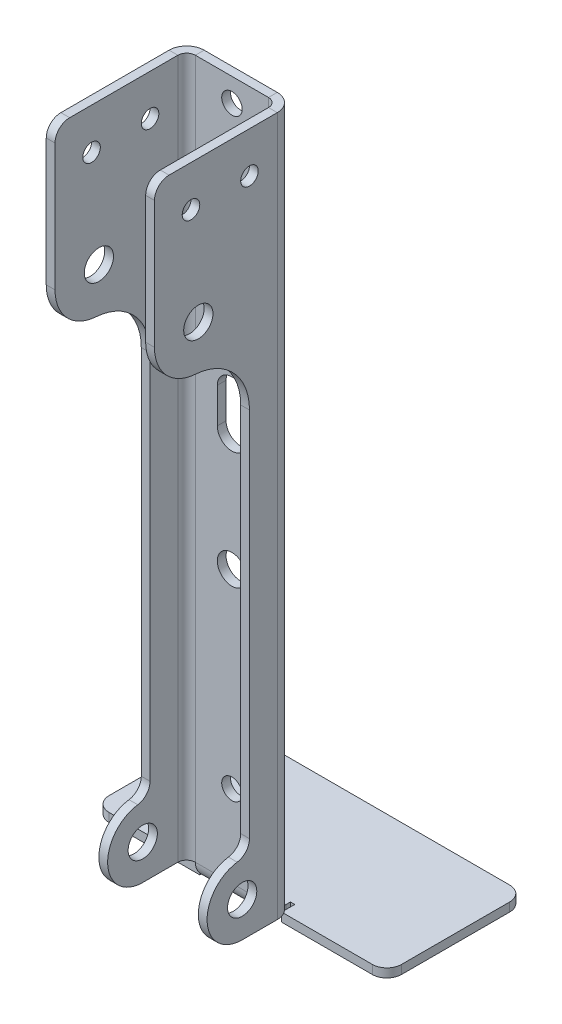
ISO-10303-21;
HEADER;
FILE_DESCRIPTION(('STEP AP214'),'2;1');
FILE_NAME('part.step','',(''),(''),'','','');
FILE_SCHEMA(('AUTOMOTIVE_DESIGN { 1 0 10303 214 1 1 1 1 }'));
ENDSEC;
DATA;
#1=APPLICATION_CONTEXT('core data for automotive mechanical design processes');
#2=APPLICATION_PROTOCOL_DEFINITION('international standard','automotive_design',2000,#1);
#3=PRODUCT_CONTEXT('',#1,'mechanical');
#4=PRODUCT('Part','Part','',(#3));
#5=PRODUCT_RELATED_PRODUCT_CATEGORY('part','',(#4));
#6=PRODUCT_DEFINITION_FORMATION('','',#4);
#7=PRODUCT_DEFINITION_CONTEXT('part definition',#1,'design');
#8=PRODUCT_DEFINITION('design','',#6,#7);
#9=PRODUCT_DEFINITION_SHAPE('','',#8);
#10=(LENGTH_UNIT() NAMED_UNIT(*) SI_UNIT(.MILLI.,.METRE.));
#11=(NAMED_UNIT(*) PLANE_ANGLE_UNIT() SI_UNIT($,.RADIAN.));
#12=(NAMED_UNIT(*) SI_UNIT($,.STERADIAN.) SOLID_ANGLE_UNIT());
#13=UNCERTAINTY_MEASURE_WITH_UNIT(LENGTH_MEASURE(1.E-05),#10,'distance_accuracy_value','');
#14=(GEOMETRIC_REPRESENTATION_CONTEXT(3) GLOBAL_UNCERTAINTY_ASSIGNED_CONTEXT((#13)) GLOBAL_UNIT_ASSIGNED_CONTEXT((#10,
#11,#12)) REPRESENTATION_CONTEXT('',''));
#15=CARTESIAN_POINT('',(0.,0.,0.));
#16=DIRECTION('',(0.,0.,1.));
#17=DIRECTION('',(1.,0.,0.));
#18=AXIS2_PLACEMENT_3D('',#15,#16,#17);
#19=CARTESIAN_POINT('',(12.5,72.9886874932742,-4.99999999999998));
#20=DIRECTION('',(1.,0.,0.));
#21=DIRECTION('',(0.,0.,1.));
#22=AXIS2_PLACEMENT_3D('',#19,#20,#21);
#23=PLANE('',#22);
#24=DIRECTION('',(0.,-1.,0.));
#25=VECTOR('',#24,1.);
#26=CARTESIAN_POINT('',(12.5,72.9886874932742,-2.99999999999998));
#27=LINE('',#26,#25);
#28=CARTESIAN_POINT('',(12.5,-148.,-2.99999999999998));
#29=VERTEX_POINT('',#28);
#30=CARTESIAN_POINT('',(12.5,-151.,-3.));
#31=VERTEX_POINT('',#30);
#32=EDGE_CURVE('E311',#29,#31,#27,.T.);
#33=ORIENTED_EDGE('',*,*,#32,.T.);
#34=DIRECTION('',(0.,0.,-1.));
#35=VECTOR('',#34,1.);
#36=CARTESIAN_POINT('',(12.5,-151.,3.));
#37=LINE('',#36,#35);
#38=CARTESIAN_POINT('',(12.5,-151.,-4.49999999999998));
#39=VERTEX_POINT('',#38);
#40=EDGE_CURVE('E394',#31,#39,#37,.T.);
#41=ORIENTED_EDGE('',*,*,#40,.T.);
#42=DIRECTION('',(0.,-1.,0.));
#43=VECTOR('',#42,1.);
#44=CARTESIAN_POINT('',(12.5,72.9886874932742,-4.49999999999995));
#45=LINE('',#44,#43);
#46=CARTESIAN_POINT('',(12.5,-148.,-4.49999999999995));
#47=VERTEX_POINT('',#46);
#48=EDGE_CURVE('E324',#47,#39,#45,.T.);
#49=ORIENTED_EDGE('',*,*,#48,.F.);
#50=DIRECTION('',(0.,0.,1.));
#51=VECTOR('',#50,1.);
#52=CARTESIAN_POINT('',(12.5,-148.,-5.));
#53=LINE('',#52,#51);
#54=EDGE_CURVE('E337',#47,#29,#53,.T.);
#55=ORIENTED_EDGE('',*,*,#54,.T.);
#56=EDGE_LOOP('',(#33,#41,#49,#55));
#57=FACE_BOUND('',#56,.T.);
#58=ADVANCED_FACE('F28',(#57),#23,.T.);
#59=CARTESIAN_POINT('',(45.,72.9886874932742,-4.49999999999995));
#60=DIRECTION('',(0.,0.,1.));
#61=DIRECTION('',(0.,-1.,0.));
#62=AXIS2_PLACEMENT_3D('',#59,#60,#61);
#63=PLANE('',#62);
#64=ORIENTED_EDGE('',*,*,#48,.T.);
#65=DIRECTION('',(-1.,0.,0.));
#66=VECTOR('',#65,1.);
#67=CARTESIAN_POINT('',(45.,-151.,-4.49999999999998));
#68=LINE('',#67,#66);
#69=CARTESIAN_POINT('',(14.,-151.,-4.49999999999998));
#70=VERTEX_POINT('',#69);
#71=EDGE_CURVE('E392',#70,#39,#68,.T.);
#72=ORIENTED_EDGE('',*,*,#71,.F.);
#73=DIRECTION('',(0.,-1.,0.));
#74=VECTOR('',#73,1.);
#75=CARTESIAN_POINT('',(14.,72.9886874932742,-4.49999999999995));
#76=LINE('',#75,#74);
#77=CARTESIAN_POINT('',(14.,-148.,-4.49999999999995));
#78=VERTEX_POINT('',#77);
#79=EDGE_CURVE('E388',#78,#70,#76,.T.);
#80=ORIENTED_EDGE('',*,*,#79,.F.);
#81=DIRECTION('',(-1.,0.,0.));
#82=VECTOR('',#81,1.);
#83=CARTESIAN_POINT('',(45.,-148.,-4.49999999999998));
#84=LINE('',#83,#82);
#85=EDGE_CURVE('E42',#78,#47,#84,.T.);
#86=ORIENTED_EDGE('',*,*,#85,.T.);
#87=EDGE_LOOP('',(#64,#72,#80,#86));
#88=FACE_BOUND('',#87,.T.);
#89=ADVANCED_FACE('F391',(#88),#63,.T.);
#90=CARTESIAN_POINT('',(14.,72.9886874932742,-4.99999999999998));
#91=DIRECTION('',(-1.,0.,0.));
#92=DIRECTION('',(0.,0.,-1.));
#93=AXIS2_PLACEMENT_3D('',#90,#91,#92);
#94=PLANE('',#93);
#95=ORIENTED_EDGE('',*,*,#79,.T.);
#96=DIRECTION('',(0.,0.,-1.));
#97=VECTOR('',#96,1.);
#98=CARTESIAN_POINT('',(14.,-151.,-5.));
#99=LINE('',#98,#97);
#100=CARTESIAN_POINT('',(14.,-151.,0.));
#101=VERTEX_POINT('',#100);
#102=EDGE_CURVE('E395',#101,#70,#99,.T.);
#103=ORIENTED_EDGE('',*,*,#102,.F.);
#104=DIRECTION('',(0.,-1.,0.));
#105=VECTOR('',#104,1.);
#106=CARTESIAN_POINT('',(14.,72.9886874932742,0.));
#107=LINE('',#106,#105);
#108=CARTESIAN_POINT('',(14.,-148.,0.));
#109=VERTEX_POINT('',#108);
#110=EDGE_CURVE('E385',#109,#101,#107,.T.);
#111=ORIENTED_EDGE('',*,*,#110,.F.);
#112=DIRECTION('',(0.,0.,-1.));
#113=VECTOR('',#112,1.);
#114=CARTESIAN_POINT('',(14.,-148.,-5.));
#115=LINE('',#114,#113);
#116=EDGE_CURVE('E50',#109,#78,#115,.T.);
#117=ORIENTED_EDGE('',*,*,#116,.T.);
#118=EDGE_LOOP('',(#95,#103,#111,#117));
#119=FACE_BOUND('',#118,.T.);
#120=ADVANCED_FACE('F398',(#119),#94,.T.);
#121=CARTESIAN_POINT('',(12.5,72.9886874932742,0.));
#122=DIRECTION('',(0.,0.,-1.));
#123=DIRECTION('',(0.,1.,0.));
#124=AXIS2_PLACEMENT_3D('',#121,#122,#123);
#125=PLANE('',#124);
#126=DIRECTION('',(1.,0.,0.));
#127=VECTOR('',#126,1.);
#128=CARTESIAN_POINT('',(12.5,-151.,0.));
#129=LINE('',#128,#127);
#130=CARTESIAN_POINT('',(45.,-151.,0.));
#131=VERTEX_POINT('',#130);
#132=EDGE_CURVE('E399',#101,#131,#129,.T.);
#133=ORIENTED_EDGE('',*,*,#132,.T.);
#134=DIRECTION('',(0.,-1.,0.));
#135=VECTOR('',#134,1.);
#136=CARTESIAN_POINT('',(45.,72.9886874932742,0.));
#137=LINE('',#136,#135);
#138=CARTESIAN_POINT('',(45.,-148.,0.));
#139=VERTEX_POINT('',#138);
#140=EDGE_CURVE('E382',#139,#131,#137,.T.);
#141=ORIENTED_EDGE('',*,*,#140,.F.);
#142=DIRECTION('',(1.,0.,0.));
#143=VECTOR('',#142,1.);
#144=CARTESIAN_POINT('',(12.5,-148.,0.));
#145=LINE('',#144,#143);
#146=EDGE_CURVE('E406',#109,#139,#145,.T.);
#147=ORIENTED_EDGE('',*,*,#146,.F.);
#148=ORIENTED_EDGE('',*,*,#110,.T.);
#149=EDGE_LOOP('',(#133,#141,#147,#148));
#150=FACE_BOUND('',#149,.T.);
#151=ADVANCED_FACE('F403',(#150),#125,.F.);
#152=CARTESIAN_POINT('',(45.,72.9886874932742,-4.99999999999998));
#153=DIRECTION('',(0.,-1.,0.));
#154=DIRECTION('',(0.,0.,-1.));
#155=AXIS2_PLACEMENT_3D('',#152,#153,#154);
#156=CYLINDRICAL_SURFACE('',#155,5.);
#157=ORIENTED_EDGE('',*,*,#140,.T.);
#158=CARTESIAN_POINT('',(45.,-151.,-5.));
#159=DIRECTION('',(0.,-1.,0.));
#160=DIRECTION('',(0.,0.,-1.));
#161=AXIS2_PLACEMENT_3D('',#158,#159,#160);
#162=CIRCLE('',#161,5.);
#163=CARTESIAN_POINT('',(50.,-151.,-5.00000000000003));
#164=VERTEX_POINT('',#163);
#165=EDGE_CURVE('E458',#164,#131,#162,.T.);
#166=ORIENTED_EDGE('',*,*,#165,.F.);
#167=DIRECTION('',(0.,-1.,0.));
#168=VECTOR('',#167,1.);
#169=CARTESIAN_POINT('',(50.,72.9886874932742,-5.));
#170=LINE('',#169,#168);
#171=CARTESIAN_POINT('',(50.,-148.,-5.));
#172=VERTEX_POINT('',#171);
#173=EDGE_CURVE('E379',#172,#164,#170,.T.);
#174=ORIENTED_EDGE('',*,*,#173,.F.);
#175=CARTESIAN_POINT('',(45.,-148.,-5.));
#176=DIRECTION('',(0.,-1.,0.));
#177=DIRECTION('',(0.,0.,-1.));
#178=AXIS2_PLACEMENT_3D('',#175,#176,#177);
#179=CIRCLE('',#178,5.);
#180=EDGE_CURVE('E408',#172,#139,#179,.T.);
#181=ORIENTED_EDGE('',*,*,#180,.T.);
#182=EDGE_LOOP('',(#157,#166,#174,#181));
#183=FACE_BOUND('',#182,.T.);
#184=ADVANCED_FACE('F515',(#183),#156,.T.);
#185=CARTESIAN_POINT('',(50.,72.9886874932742,-42.));
#186=DIRECTION('',(1.,0.,0.));
#187=DIRECTION('',(0.,1.,0.));
#188=AXIS2_PLACEMENT_3D('',#185,#186,#187);
#189=PLANE('',#188);
#190=ORIENTED_EDGE('',*,*,#173,.T.);
#191=DIRECTION('',(0.,0.,1.));
#192=VECTOR('',#191,1.);
#193=CARTESIAN_POINT('',(50.,-151.,-42.));
#194=LINE('',#193,#192);
#195=CARTESIAN_POINT('',(50.,-151.,-42.));
#196=VERTEX_POINT('',#195);
#197=EDGE_CURVE('E452',#196,#164,#194,.T.);
#198=ORIENTED_EDGE('',*,*,#197,.F.);
#199=DIRECTION('',(0.,-1.,0.));
#200=VECTOR('',#199,1.);
#201=CARTESIAN_POINT('',(50.,72.9886874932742,-42.));
#202=LINE('',#201,#200);
#203=CARTESIAN_POINT('',(50.,-148.,-42.));
#204=VERTEX_POINT('',#203);
#205=EDGE_CURVE('E376',#204,#196,#202,.T.);
#206=ORIENTED_EDGE('',*,*,#205,.F.);
#207=DIRECTION('',(0.,0.,1.));
#208=VECTOR('',#207,1.);
#209=CARTESIAN_POINT('',(50.,-148.,-42.));
#210=LINE('',#209,#208);
#211=EDGE_CURVE('E410',#204,#172,#210,.T.);
#212=ORIENTED_EDGE('',*,*,#211,.T.);
#213=EDGE_LOOP('',(#190,#198,#206,#212));
#214=FACE_BOUND('',#213,.T.);
#215=ADVANCED_FACE('F518',(#214),#189,.T.);
#216=CARTESIAN_POINT('',(45.,72.9886874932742,-42.));
#217=DIRECTION('',(0.,-1.,0.));
#218=DIRECTION('',(0.,0.,-1.));
#219=AXIS2_PLACEMENT_3D('',#216,#217,#218);
#220=CYLINDRICAL_SURFACE('',#219,5.);
#221=CARTESIAN_POINT('',(45.,-151.,-42.));
#222=DIRECTION('',(0.,1.,0.));
#223=DIRECTION('',(0.,0.,1.));
#224=AXIS2_PLACEMENT_3D('',#221,#222,#223);
#225=CIRCLE('',#224,5.);
#226=CARTESIAN_POINT('',(45.,-151.,-47.));
#227=VERTEX_POINT('',#226);
#228=EDGE_CURVE('E449',#196,#227,#225,.T.);
#229=ORIENTED_EDGE('',*,*,#228,.T.);
#230=DIRECTION('',(0.,-1.,0.));
#231=VECTOR('',#230,1.);
#232=CARTESIAN_POINT('',(45.,72.9886874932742,-47.));
#233=LINE('',#232,#231);
#234=CARTESIAN_POINT('',(45.,-148.,-47.));
#235=VERTEX_POINT('',#234);
#236=EDGE_CURVE('E373',#235,#227,#233,.T.);
#237=ORIENTED_EDGE('',*,*,#236,.F.);
#238=CARTESIAN_POINT('',(45.,-148.,-42.));
#239=DIRECTION('',(0.,1.,0.));
#240=DIRECTION('',(0.,0.,1.));
#241=AXIS2_PLACEMENT_3D('',#238,#239,#240);
#242=CIRCLE('',#241,5.);
#243=EDGE_CURVE('E416',#204,#235,#242,.T.);
#244=ORIENTED_EDGE('',*,*,#243,.F.);
#245=ORIENTED_EDGE('',*,*,#205,.T.);
#246=EDGE_LOOP('',(#229,#237,#244,#245));
#247=FACE_BOUND('',#246,.T.);
#248=ADVANCED_FACE('F522',(#247),#220,.T.);
#249=CARTESIAN_POINT('',(45.,72.9886874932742,-47.));
#250=DIRECTION('',(0.,0.,1.));
#251=DIRECTION('',(-1.,0.,0.));
#252=AXIS2_PLACEMENT_3D('',#249,#250,#251);
#253=PLANE('',#252);
#254=DIRECTION('',(-1.,0.,0.));
#255=VECTOR('',#254,1.);
#256=CARTESIAN_POINT('',(45.,-151.,-47.));
#257=LINE('',#256,#255);
#258=CARTESIAN_POINT('',(-45.,-151.,-47.));
#259=VERTEX_POINT('',#258);
#260=EDGE_CURVE('E447',#227,#259,#257,.T.);
#261=ORIENTED_EDGE('',*,*,#260,.T.);
#262=DIRECTION('',(0.,-1.,0.));
#263=VECTOR('',#262,1.);
#264=CARTESIAN_POINT('',(-45.,72.9886874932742,-47.));
#265=LINE('',#264,#263);
#266=CARTESIAN_POINT('',(-45.,-148.,-47.));
#267=VERTEX_POINT('',#266);
#268=EDGE_CURVE('E370',#267,#259,#265,.T.);
#269=ORIENTED_EDGE('',*,*,#268,.F.);
#270=DIRECTION('',(-1.,0.,0.));
#271=VECTOR('',#270,1.);
#272=CARTESIAN_POINT('',(45.,-148.,-47.));
#273=LINE('',#272,#271);
#274=EDGE_CURVE('E419',#235,#267,#273,.T.);
#275=ORIENTED_EDGE('',*,*,#274,.F.);
#276=ORIENTED_EDGE('',*,*,#236,.T.);
#277=EDGE_LOOP('',(#261,#269,#275,#276));
#278=FACE_BOUND('',#277,.T.);
#279=ADVANCED_FACE('F445',(#278),#253,.F.);
#280=CARTESIAN_POINT('',(-45.,72.9886874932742,-42.));
#281=DIRECTION('',(0.,-1.,0.));
#282=DIRECTION('',(0.,0.,-1.));
#283=AXIS2_PLACEMENT_3D('',#280,#281,#282);
#284=CYLINDRICAL_SURFACE('',#283,5.);
#285=CARTESIAN_POINT('',(-45.,-151.,-42.));
#286=DIRECTION('',(0.,1.,0.));
#287=DIRECTION('',(0.,0.,1.));
#288=AXIS2_PLACEMENT_3D('',#285,#286,#287);
#289=CIRCLE('',#288,5.);
#290=CARTESIAN_POINT('',(-50.,-151.,-42.));
#291=VERTEX_POINT('',#290);
#292=EDGE_CURVE('E450',#259,#291,#289,.T.);
#293=ORIENTED_EDGE('',*,*,#292,.T.);
#294=DIRECTION('',(0.,-1.,0.));
#295=VECTOR('',#294,1.);
#296=CARTESIAN_POINT('',(-50.,72.9886874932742,-41.9999999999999));
#297=LINE('',#296,#295);
#298=CARTESIAN_POINT('',(-50.,-148.,-41.9999999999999));
#299=VERTEX_POINT('',#298);
#300=EDGE_CURVE('E367',#299,#291,#297,.T.);
#301=ORIENTED_EDGE('',*,*,#300,.F.);
#302=CARTESIAN_POINT('',(-45.,-148.,-42.));
#303=DIRECTION('',(0.,1.,0.));
#304=DIRECTION('',(0.,0.,1.));
#305=AXIS2_PLACEMENT_3D('',#302,#303,#304);
#306=CIRCLE('',#305,5.);
#307=EDGE_CURVE('E422',#267,#299,#306,.T.);
#308=ORIENTED_EDGE('',*,*,#307,.F.);
#309=ORIENTED_EDGE('',*,*,#268,.T.);
#310=EDGE_LOOP('',(#293,#301,#308,#309));
#311=FACE_BOUND('',#310,.T.);
#312=ADVANCED_FACE('F442',(#311),#284,.T.);
#313=CARTESIAN_POINT('',(-50.,72.9886874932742,-5.));
#314=DIRECTION('',(-1.,0.,0.));
#315=DIRECTION('',(0.,0.,-1.));
#316=AXIS2_PLACEMENT_3D('',#313,#314,#315);
#317=PLANE('',#316);
#318=ORIENTED_EDGE('',*,*,#300,.T.);
#319=DIRECTION('',(0.,0.,-1.));
#320=VECTOR('',#319,1.);
#321=CARTESIAN_POINT('',(-50.,-151.,-5.00000000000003));
#322=LINE('',#321,#320);
#323=CARTESIAN_POINT('',(-50.,-151.,-5.00000000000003));
#324=VERTEX_POINT('',#323);
#325=EDGE_CURVE('E438',#324,#291,#322,.T.);
#326=ORIENTED_EDGE('',*,*,#325,.F.);
#327=DIRECTION('',(0.,-1.,0.));
#328=VECTOR('',#327,1.);
#329=CARTESIAN_POINT('',(-50.,72.9886874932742,-5.));
#330=LINE('',#329,#328);
#331=CARTESIAN_POINT('',(-50.,-148.,-5.));
#332=VERTEX_POINT('',#331);
#333=EDGE_CURVE('E364',#332,#324,#330,.T.);
#334=ORIENTED_EDGE('',*,*,#333,.F.);
#335=DIRECTION('',(0.,0.,-1.));
#336=VECTOR('',#335,1.);
#337=CARTESIAN_POINT('',(-50.,-148.,-5.00000000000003));
#338=LINE('',#337,#336);
#339=EDGE_CURVE('E425',#332,#299,#338,.T.);
#340=ORIENTED_EDGE('',*,*,#339,.T.);
#341=EDGE_LOOP('',(#318,#326,#334,#340));
#342=FACE_BOUND('',#341,.T.);
#343=ADVANCED_FACE('F436',(#342),#317,.T.);
#344=CARTESIAN_POINT('',(-45.,72.9886874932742,-4.99999999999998));
#345=DIRECTION('',(0.,-1.,0.));
#346=DIRECTION('',(0.,0.,-1.));
#347=AXIS2_PLACEMENT_3D('',#344,#345,#346);
#348=CYLINDRICAL_SURFACE('',#347,5.);
#349=ORIENTED_EDGE('',*,*,#333,.T.);
#350=CARTESIAN_POINT('',(-45.,-151.,-5.));
#351=DIRECTION('',(0.,-1.,0.));
#352=DIRECTION('',(0.,0.,-1.));
#353=AXIS2_PLACEMENT_3D('',#350,#351,#352);
#354=CIRCLE('',#353,5.);
#355=CARTESIAN_POINT('',(-45.,-151.,0.));
#356=VERTEX_POINT('',#355);
#357=EDGE_CURVE('E481',#356,#324,#354,.T.);
#358=ORIENTED_EDGE('',*,*,#357,.F.);
#359=DIRECTION('',(0.,-1.,0.));
#360=VECTOR('',#359,1.);
#361=CARTESIAN_POINT('',(-45.,72.9886874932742,0.));
#362=LINE('',#361,#360);
#363=CARTESIAN_POINT('',(-45.,-148.,0.));
#364=VERTEX_POINT('',#363);
#365=EDGE_CURVE('E361',#364,#356,#362,.T.);
#366=ORIENTED_EDGE('',*,*,#365,.F.);
#367=CARTESIAN_POINT('',(-45.,-148.,-5.));
#368=DIRECTION('',(0.,-1.,0.));
#369=DIRECTION('',(0.,0.,-1.));
#370=AXIS2_PLACEMENT_3D('',#367,#368,#369);
#371=CIRCLE('',#370,5.);
#372=EDGE_CURVE('E349',#364,#332,#371,.T.);
#373=ORIENTED_EDGE('',*,*,#372,.T.);
#374=EDGE_LOOP('',(#349,#358,#366,#373));
#375=FACE_BOUND('',#374,.T.);
#376=ADVANCED_FACE('F430',(#375),#348,.T.);
#377=CARTESIAN_POINT('',(-12.5,72.9886874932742,0.));
#378=DIRECTION('',(0.,0.,1.));
#379=DIRECTION('',(0.,-1.,0.));
#380=AXIS2_PLACEMENT_3D('',#377,#378,#379);
#381=PLANE('',#380);
#382=ORIENTED_EDGE('',*,*,#365,.T.);
#383=DIRECTION('',(-1.,0.,0.));
#384=VECTOR('',#383,1.);
#385=CARTESIAN_POINT('',(-12.5,-151.,0.));
#386=LINE('',#385,#384);
#387=CARTESIAN_POINT('',(-14.,-151.,0.));
#388=VERTEX_POINT('',#387);
#389=EDGE_CURVE('E480',#388,#356,#386,.T.);
#390=ORIENTED_EDGE('',*,*,#389,.F.);
#391=DIRECTION('',(0.,-1.,0.));
#392=VECTOR('',#391,1.);
#393=CARTESIAN_POINT('',(-14.,72.9886874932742,0.));
#394=LINE('',#393,#392);
#395=CARTESIAN_POINT('',(-14.,-148.,0.));
#396=VERTEX_POINT('',#395);
#397=EDGE_CURVE('E358',#396,#388,#394,.T.);
#398=ORIENTED_EDGE('',*,*,#397,.F.);
#399=DIRECTION('',(-1.,0.,0.));
#400=VECTOR('',#399,1.);
#401=CARTESIAN_POINT('',(-12.5,-148.,0.));
#402=LINE('',#401,#400);
#403=EDGE_CURVE('E345',#396,#364,#402,.T.);
#404=ORIENTED_EDGE('',*,*,#403,.T.);
#405=EDGE_LOOP('',(#382,#390,#398,#404));
#406=FACE_BOUND('',#405,.T.);
#407=ADVANCED_FACE('F478',(#406),#381,.T.);
#408=CARTESIAN_POINT('',(-14.,72.9886874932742,-4.99999999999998));
#409=DIRECTION('',(1.,0.,0.));
#410=DIRECTION('',(0.,0.,1.));
#411=AXIS2_PLACEMENT_3D('',#408,#409,#410);
#412=PLANE('',#411);
#413=ORIENTED_EDGE('',*,*,#397,.T.);
#414=DIRECTION('',(0.,0.,1.));
#415=VECTOR('',#414,1.);
#416=CARTESIAN_POINT('',(-14.,-151.,-5.));
#417=LINE('',#416,#415);
#418=CARTESIAN_POINT('',(-14.,-151.,-4.49999999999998));
#419=VERTEX_POINT('',#418);
#420=EDGE_CURVE('E476',#419,#388,#417,.T.);
#421=ORIENTED_EDGE('',*,*,#420,.F.);
#422=DIRECTION('',(0.,-1.,0.));
#423=VECTOR('',#422,1.);
#424=CARTESIAN_POINT('',(-14.,72.9886874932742,-4.49999999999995));
#425=LINE('',#424,#423);
#426=CARTESIAN_POINT('',(-14.,-148.,-4.49999999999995));
#427=VERTEX_POINT('',#426);
#428=EDGE_CURVE('E355',#427,#419,#425,.T.);
#429=ORIENTED_EDGE('',*,*,#428,.F.);
#430=DIRECTION('',(0.,0.,1.));
#431=VECTOR('',#430,1.);
#432=CARTESIAN_POINT('',(-14.,-148.,-5.));
#433=LINE('',#432,#431);
#434=EDGE_CURVE('E464',#427,#396,#433,.T.);
#435=ORIENTED_EDGE('',*,*,#434,.T.);
#436=EDGE_LOOP('',(#413,#421,#429,#435));
#437=FACE_BOUND('',#436,.T.);
#438=ADVANCED_FACE('F474',(#437),#412,.T.);
#439=CARTESIAN_POINT('',(45.,72.9886874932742,-4.49999999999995));
#440=DIRECTION('',(0.,0.,1.));
#441=DIRECTION('',(0.,-1.,0.));
#442=AXIS2_PLACEMENT_3D('',#439,#440,#441);
#443=PLANE('',#442);
#444=ORIENTED_EDGE('',*,*,#428,.T.);
#445=DIRECTION('',(-1.,0.,0.));
#446=VECTOR('',#445,1.);
#447=CARTESIAN_POINT('',(45.,-151.,-4.49999999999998));
#448=LINE('',#447,#446);
#449=CARTESIAN_POINT('',(-12.5,-151.,-4.49999999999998));
#450=VERTEX_POINT('',#449);
#451=EDGE_CURVE('E484',#450,#419,#448,.T.);
#452=ORIENTED_EDGE('',*,*,#451,.F.);
#453=DIRECTION('',(0.,-1.,0.));
#454=VECTOR('',#453,1.);
#455=CARTESIAN_POINT('',(-12.5,72.9886874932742,-4.49999999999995));
#456=LINE('',#455,#454);
#457=CARTESIAN_POINT('',(-12.5,-148.,-4.49999999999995));
#458=VERTEX_POINT('',#457);
#459=EDGE_CURVE('E347',#458,#450,#456,.T.);
#460=ORIENTED_EDGE('',*,*,#459,.F.);
#461=DIRECTION('',(-1.,0.,0.));
#462=VECTOR('',#461,1.);
#463=CARTESIAN_POINT('',(45.,-148.,-4.49999999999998));
#464=LINE('',#463,#462);
#465=EDGE_CURVE('E339',#458,#427,#464,.T.);
#466=ORIENTED_EDGE('',*,*,#465,.T.);
#467=EDGE_LOOP('',(#444,#452,#460,#466));
#468=FACE_BOUND('',#467,.T.);
#469=ADVANCED_FACE('F469',(#468),#443,.T.);
#470=CARTESIAN_POINT('',(-12.5,72.9886874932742,-4.99999999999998));
#471=DIRECTION('',(-1.,0.,0.));
#472=DIRECTION('',(0.,0.,-1.));
#473=AXIS2_PLACEMENT_3D('',#470,#471,#472);
#474=PLANE('',#473);
#475=ORIENTED_EDGE('',*,*,#459,.T.);
#476=DIRECTION('',(0.,0.,1.));
#477=VECTOR('',#476,1.);
#478=CARTESIAN_POINT('',(-12.5,-151.,-4.99999999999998));
#479=LINE('',#478,#477);
#480=CARTESIAN_POINT('',(-12.5,-151.,-2.99999999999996));
#481=VERTEX_POINT('',#480);
#482=EDGE_CURVE('E11',#450,#481,#479,.T.);
#483=ORIENTED_EDGE('',*,*,#482,.T.);
#484=DIRECTION('',(0.,-1.,0.));
#485=VECTOR('',#484,1.);
#486=CARTESIAN_POINT('',(-12.5,72.9886874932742,-2.99999999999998));
#487=LINE('',#486,#485);
#488=CARTESIAN_POINT('',(-12.5,-148.,-2.99999999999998));
#489=VERTEX_POINT('',#488);
#490=EDGE_CURVE('E344',#489,#481,#487,.T.);
#491=ORIENTED_EDGE('',*,*,#490,.F.);
#492=DIRECTION('',(0.,0.,1.));
#493=VECTOR('',#492,1.);
#494=CARTESIAN_POINT('',(-12.5,-148.,-4.99999999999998));
#495=LINE('',#494,#493);
#496=EDGE_CURVE('E35',#458,#489,#495,.T.);
#497=ORIENTED_EDGE('',*,*,#496,.F.);
#498=EDGE_LOOP('',(#475,#483,#491,#497));
#499=FACE_BOUND('',#498,.T.);
#500=ADVANCED_FACE('F501',(#499),#474,.T.);
#501=CARTESIAN_POINT('',(45.,-148.,-5.));
#502=DIRECTION('',(0.,-1.,0.));
#503=DIRECTION('',(0.,0.,-1.));
#504=AXIS2_PLACEMENT_3D('',#501,#502,#503);
#505=PLANE('',#504);
#506=ORIENTED_EDGE('',*,*,#496,.T.);
#507=DIRECTION('',(1.,0.,0.));
#508=VECTOR('',#507,1.);
#509=CARTESIAN_POINT('',(12.5,-148.,-2.99999999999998));
#510=LINE('',#509,#508);
#511=EDGE_CURVE('E330',#489,#29,#510,.T.);
#512=ORIENTED_EDGE('',*,*,#511,.T.);
#513=ORIENTED_EDGE('',*,*,#54,.F.);
#514=ORIENTED_EDGE('',*,*,#85,.F.);
#515=ORIENTED_EDGE('',*,*,#116,.F.);
#516=ORIENTED_EDGE('',*,*,#146,.T.);
#517=ORIENTED_EDGE('',*,*,#180,.F.);
#518=ORIENTED_EDGE('',*,*,#211,.F.);
#519=ORIENTED_EDGE('',*,*,#243,.T.);
#520=ORIENTED_EDGE('',*,*,#274,.T.);
#521=ORIENTED_EDGE('',*,*,#307,.T.);
#522=ORIENTED_EDGE('',*,*,#339,.F.);
#523=ORIENTED_EDGE('',*,*,#372,.F.);
#524=ORIENTED_EDGE('',*,*,#403,.F.);
#525=ORIENTED_EDGE('',*,*,#434,.F.);
#526=ORIENTED_EDGE('',*,*,#465,.F.);
#527=EDGE_LOOP('',(#506,#512,#513,#514,#515,#516,#517,#518,#519,#520,#521,#522,#523,#524,#525,#526));
#528=FACE_BOUND('',#527,.T.);
#529=ADVANCED_FACE('F342',(#528),#505,.F.);
#530=CARTESIAN_POINT('',(45.,-151.,-5.));
#531=DIRECTION('',(0.,-1.,0.));
#532=DIRECTION('',(0.,0.,-1.));
#533=AXIS2_PLACEMENT_3D('',#530,#531,#532);
#534=PLANE('',#533);
#535=DIRECTION('',(1.,0.,0.));
#536=VECTOR('',#535,1.);
#537=CARTESIAN_POINT('',(12.5,-151.,-2.99999999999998));
#538=LINE('',#537,#536);
#539=EDGE_CURVE('E462',#481,#31,#538,.T.);
#540=ORIENTED_EDGE('',*,*,#539,.F.);
#541=ORIENTED_EDGE('',*,*,#482,.F.);
#542=ORIENTED_EDGE('',*,*,#451,.T.);
#543=ORIENTED_EDGE('',*,*,#420,.T.);
#544=ORIENTED_EDGE('',*,*,#389,.T.);
#545=ORIENTED_EDGE('',*,*,#357,.T.);
#546=ORIENTED_EDGE('',*,*,#325,.T.);
#547=ORIENTED_EDGE('',*,*,#292,.F.);
#548=ORIENTED_EDGE('',*,*,#260,.F.);
#549=ORIENTED_EDGE('',*,*,#228,.F.);
#550=ORIENTED_EDGE('',*,*,#197,.T.);
#551=ORIENTED_EDGE('',*,*,#165,.T.);
#552=ORIENTED_EDGE('',*,*,#132,.F.);
#553=ORIENTED_EDGE('',*,*,#102,.T.);
#554=ORIENTED_EDGE('',*,*,#71,.T.);
#555=ORIENTED_EDGE('',*,*,#40,.F.);
#556=EDGE_LOOP('',(#540,#541,#542,#543,#544,#545,#546,#547,#548,#549,#550,#551,#552,#553,#554,#555));
#557=FACE_BOUND('',#556,.T.);
#558=ADVANCED_FACE('F488',(#557),#534,.T.);
#559=CARTESIAN_POINT('',(12.5,-145.,6.));
#560=DIRECTION('',(0.,1.,0.));
#561=DIRECTION('',(0.,0.,1.));
#562=AXIS2_PLACEMENT_3D('',#559,#560,#561);
#563=PLANE('',#562);
#564=CARTESIAN_POINT('',(-12.5,-145.,6.));
#565=DIRECTION('',(0.,-1.,0.));
#566=DIRECTION('',(1.,0.,0.));
#567=AXIS2_PLACEMENT_3D('',#564,#565,#566);
#568=CIRCLE('',#567,6.);
#569=CARTESIAN_POINT('',(-18.5,-145.,6.));
#570=VERTEX_POINT('',#569);
#571=CARTESIAN_POINT('',(-12.5,-145.,0.));
#572=VERTEX_POINT('',#571);
#573=EDGE_CURVE('E571',#570,#572,#568,.T.);
#574=ORIENTED_EDGE('',*,*,#573,.T.);
#575=DIRECTION('',(0.,0.,1.));
#576=VECTOR('',#575,1.);
#577=CARTESIAN_POINT('',(-12.5,-145.,1.5));
#578=LINE('',#577,#576);
#579=CARTESIAN_POINT('',(-12.5,-145.,3.));
#580=VERTEX_POINT('',#579);
#581=EDGE_CURVE('E559',#572,#580,#578,.T.);
#582=ORIENTED_EDGE('',*,*,#581,.T.);
#583=CARTESIAN_POINT('',(-12.5,-145.,6.));
#584=DIRECTION('',(0.,-1.,0.));
#585=DIRECTION('',(1.,0.,0.));
#586=AXIS2_PLACEMENT_3D('',#583,#584,#585);
#587=CIRCLE('',#586,3.);
#588=CARTESIAN_POINT('',(-15.5,-145.,6.));
#589=VERTEX_POINT('',#588);
#590=EDGE_CURVE('E564',#589,#580,#587,.T.);
#591=ORIENTED_EDGE('',*,*,#590,.F.);
#592=DIRECTION('',(-1.,0.,0.));
#593=VECTOR('',#592,1.);
#594=CARTESIAN_POINT('',(466.824633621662,-145.,6.));
#595=LINE('',#594,#593);
#596=EDGE_CURVE('E878',#589,#570,#595,.T.);
#597=ORIENTED_EDGE('',*,*,#596,.T.);
#598=EDGE_LOOP('',(#574,#582,#591,#597));
#599=FACE_BOUND('',#598,.T.);
#600=ADVANCED_FACE('F490',(#599),#563,.F.);
#601=CARTESIAN_POINT('',(-18.5,-133.,18.));
#602=DIRECTION('',(1.,0.,0.));
#603=DIRECTION('',(0.,1.,0.));
#604=AXIS2_PLACEMENT_3D('',#601,#602,#603);
#605=CYLINDRICAL_SURFACE('',#604,5.00000000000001);
#606=CARTESIAN_POINT('',(-18.5,-133.,18.));
#607=DIRECTION('',(-1.,0.,0.));
#608=DIRECTION('',(0.,-1.,0.));
#609=AXIS2_PLACEMENT_3D('',#606,#607,#608);
#610=CIRCLE('',#609,5.00000000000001);
#611=CARTESIAN_POINT('',(-18.5,-138.,18.));
#612=VERTEX_POINT('',#611);
#613=EDGE_CURVE('E848',#612,#612,#610,.T.);
#614=ORIENTED_EDGE('',*,*,#613,.T.);
#615=EDGE_LOOP('',(#614));
#616=FACE_BOUND('',#615,.T.);
#617=CARTESIAN_POINT('',(-15.5,-133.,18.));
#618=DIRECTION('',(-1.,0.,0.));
#619=DIRECTION('',(0.,-1.,0.));
#620=AXIS2_PLACEMENT_3D('',#617,#618,#619);
#621=CIRCLE('',#620,5.00000000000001);
#622=CARTESIAN_POINT('',(-15.5,-138.,18.));
#623=VERTEX_POINT('',#622);
#624=EDGE_CURVE('E810',#623,#623,#621,.T.);
#625=ORIENTED_EDGE('',*,*,#624,.F.);
#626=EDGE_LOOP('',(#625));
#627=FACE_BOUND('',#626,.T.);
#628=ADVANCED_FACE('F496',(#616,#627),#605,.F.);
#629=CARTESIAN_POINT('',(-18.5,80.,35.5));
#630=DIRECTION('',(1.,0.,0.));
#631=DIRECTION('',(0.,1.,0.));
#632=AXIS2_PLACEMENT_3D('',#629,#630,#631);
#633=CYLINDRICAL_SURFACE('',#632,3.);
#634=CARTESIAN_POINT('',(-18.5,80.,35.5));
#635=DIRECTION('',(-1.,0.,0.));
#636=DIRECTION('',(0.,-1.,0.));
#637=AXIS2_PLACEMENT_3D('',#634,#635,#636);
#638=CIRCLE('',#637,3.);
#639=CARTESIAN_POINT('',(-18.5,77.,35.5));
#640=VERTEX_POINT('',#639);
#641=EDGE_CURVE('E845',#640,#640,#638,.T.);
#642=ORIENTED_EDGE('',*,*,#641,.T.);
#643=EDGE_LOOP('',(#642));
#644=FACE_BOUND('',#643,.T.);
#645=CARTESIAN_POINT('',(-15.5,80.,35.5));
#646=DIRECTION('',(-1.,0.,0.));
#647=DIRECTION('',(0.,-1.,0.));
#648=AXIS2_PLACEMENT_3D('',#645,#646,#647);
#649=CIRCLE('',#648,3.);
#650=CARTESIAN_POINT('',(-15.5,77.,35.5));
#651=VERTEX_POINT('',#650);
#652=EDGE_CURVE('E807',#651,#651,#649,.T.);
#653=ORIENTED_EDGE('',*,*,#652,.F.);
#654=EDGE_LOOP('',(#653));
#655=FACE_BOUND('',#654,.T.);
#656=ADVANCED_FACE('F1054',(#644,#655),#633,.F.);
#657=CARTESIAN_POINT('',(-18.5,45.5,33.));
#658=DIRECTION('',(1.,0.,0.));
#659=DIRECTION('',(0.,1.,0.));
#660=AXIS2_PLACEMENT_3D('',#657,#658,#659);
#661=CYLINDRICAL_SURFACE('',#660,5.00000000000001);
#662=CARTESIAN_POINT('',(-18.5,45.5,33.));
#663=DIRECTION('',(-1.,0.,0.));
#664=DIRECTION('',(0.,-1.,0.));
#665=AXIS2_PLACEMENT_3D('',#662,#663,#664);
#666=CIRCLE('',#665,5.00000000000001);
#667=CARTESIAN_POINT('',(-18.5,40.5,33.));
#668=VERTEX_POINT('',#667);
#669=EDGE_CURVE('E842',#668,#668,#666,.T.);
#670=ORIENTED_EDGE('',*,*,#669,.T.);
#671=EDGE_LOOP('',(#670));
#672=FACE_BOUND('',#671,.T.);
#673=CARTESIAN_POINT('',(-15.5,45.5,33.));
#674=DIRECTION('',(-1.,0.,0.));
#675=DIRECTION('',(0.,-1.,0.));
#676=AXIS2_PLACEMENT_3D('',#673,#674,#675);
#677=CIRCLE('',#676,5.00000000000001);
#678=CARTESIAN_POINT('',(-15.5,40.5,33.));
#679=VERTEX_POINT('',#678);
#680=EDGE_CURVE('E804',#679,#679,#677,.T.);
#681=ORIENTED_EDGE('',*,*,#680,.F.);
#682=EDGE_LOOP('',(#681));
#683=FACE_BOUND('',#682,.T.);
#684=ADVANCED_FACE('F1051',(#672,#683),#661,.F.);
#685=CARTESIAN_POINT('',(-18.5,89.,43.));
#686=DIRECTION('',(-1.,0.,0.));
#687=DIRECTION('',(0.,-1.,0.));
#688=AXIS2_PLACEMENT_3D('',#685,#686,#687);
#689=PLANE('',#688);
#690=DIRECTION('',(0.,1.,0.));
#691=VECTOR('',#690,1.);
#692=CARTESIAN_POINT('',(-18.5,94.,6.00000000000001));
#693=LINE('',#692,#691);
#694=CARTESIAN_POINT('',(-18.5,94.,6.00000000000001));
#695=VERTEX_POINT('',#694);
#696=EDGE_CURVE('E816',#570,#695,#693,.T.);
#697=ORIENTED_EDGE('',*,*,#696,.F.);
#698=DIRECTION('',(0.,0.,-1.));
#699=VECTOR('',#698,1.);
#700=CARTESIAN_POINT('',(-18.5,-145.,18.));
#701=LINE('',#700,#699);
#702=CARTESIAN_POINT('',(-18.5,-145.,18.));
#703=VERTEX_POINT('',#702);
#704=EDGE_CURVE('E818',#703,#570,#701,.T.);
#705=ORIENTED_EDGE('',*,*,#704,.F.);
#706=CARTESIAN_POINT('',(-18.5,-133.,18.));
#707=DIRECTION('',(-1.,0.,0.));
#708=DIRECTION('',(0.,-1.,0.));
#709=AXIS2_PLACEMENT_3D('',#706,#707,#708);
#710=CIRCLE('',#709,12.);
#711=CARTESIAN_POINT('',(-18.5,-121.121620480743,19.7041420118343));
#712=VERTEX_POINT('',#711);
#713=EDGE_CURVE('E821',#703,#712,#710,.T.);
#714=ORIENTED_EDGE('',*,*,#713,.T.);
#715=CARTESIAN_POINT('',(-18.5,-116.271282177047,20.4));
#716=DIRECTION('',(-1.,0.,0.));
#717=DIRECTION('',(0.,-1.,0.));
#718=AXIS2_PLACEMENT_3D('',#715,#716,#717);
#719=CIRCLE('',#718,4.89999999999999);
#720=CARTESIAN_POINT('',(-18.5,-116.271282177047,15.5));
#721=VERTEX_POINT('',#720);
#722=EDGE_CURVE('E823',#721,#712,#719,.T.);
#723=ORIENTED_EDGE('',*,*,#722,.F.);
#724=DIRECTION('',(0.,-1.,0.));
#725=VECTOR('',#724,1.);
#726=CARTESIAN_POINT('',(-18.5,10.6826192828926,15.5));
#727=LINE('',#726,#725);
#728=CARTESIAN_POINT('',(-18.5,10.6826192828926,15.5));
#729=VERTEX_POINT('',#728);
#730=EDGE_CURVE('E826',#729,#721,#727,.T.);
#731=ORIENTED_EDGE('',*,*,#730,.F.);
#732=CARTESIAN_POINT('',(-18.5,10.6826192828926,35.4));
#733=DIRECTION('',(-1.,0.,0.));
#734=DIRECTION('',(0.,-1.,0.));
#735=AXIS2_PLACEMENT_3D('',#732,#733,#734);
#736=CIRCLE('',#735,19.9);
#737=CARTESIAN_POINT('',(-18.5,30.535509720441,34.0315186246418));
#738=VERTEX_POINT('',#737);
#739=EDGE_CURVE('E829',#738,#729,#736,.T.);
#740=ORIENTED_EDGE('',*,*,#739,.F.);
#741=CARTESIAN_POINT('',(-18.5,45.5,33.));
#742=DIRECTION('',(-1.,0.,0.));
#743=DIRECTION('',(0.,-1.,0.));
#744=AXIS2_PLACEMENT_3D('',#741,#742,#743);
#745=CIRCLE('',#744,15.);
#746=CARTESIAN_POINT('',(-18.5,45.5,48.));
#747=VERTEX_POINT('',#746);
#748=EDGE_CURVE('E832',#738,#747,#745,.T.);
#749=ORIENTED_EDGE('',*,*,#748,.T.);
#750=DIRECTION('',(0.,-1.,0.));
#751=VECTOR('',#750,1.);
#752=CARTESIAN_POINT('',(-18.5,89.,48.));
#753=LINE('',#752,#751);
#754=CARTESIAN_POINT('',(-18.5,89.,48.));
#755=VERTEX_POINT('',#754);
#756=EDGE_CURVE('E834',#755,#747,#753,.T.);
#757=ORIENTED_EDGE('',*,*,#756,.F.);
#758=CARTESIAN_POINT('',(-18.5,89.,43.));
#759=DIRECTION('',(-1.,0.,0.));
#760=DIRECTION('',(0.,-1.,0.));
#761=AXIS2_PLACEMENT_3D('',#758,#759,#760);
#762=CIRCLE('',#761,4.99999999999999);
#763=CARTESIAN_POINT('',(-18.5,94.,43.));
#764=VERTEX_POINT('',#763);
#765=EDGE_CURVE('E837',#755,#764,#762,.T.);
#766=ORIENTED_EDGE('',*,*,#765,.T.);
#767=DIRECTION('',(0.,0.,1.));
#768=VECTOR('',#767,1.);
#769=CARTESIAN_POINT('',(-18.5,94.,0.));
#770=LINE('',#769,#768);
#771=EDGE_CURVE('E839',#695,#764,#770,.T.);
#772=ORIENTED_EDGE('',*,*,#771,.F.);
#773=EDGE_LOOP('',(#697,#705,#714,#723,#731,#740,#749,#757,#766,#772));
#774=FACE_BOUND('',#773,.T.);
#775=CARTESIAN_POINT('',(-18.5,80.,15.5));
#776=DIRECTION('',(-1.,0.,0.));
#777=DIRECTION('',(0.,-1.,0.));
#778=AXIS2_PLACEMENT_3D('',#775,#776,#777);
#779=CIRCLE('',#778,3.);
#780=CARTESIAN_POINT('',(-18.5,77.,15.5));
#781=VERTEX_POINT('',#780);
#782=EDGE_CURVE('E813',#781,#781,#779,.T.);
#783=ORIENTED_EDGE('',*,*,#782,.F.);
#784=EDGE_LOOP('',(#783));
#785=FACE_BOUND('',#784,.T.);
#786=ORIENTED_EDGE('',*,*,#669,.F.);
#787=EDGE_LOOP('',(#786));
#788=FACE_BOUND('',#787,.T.);
#789=ORIENTED_EDGE('',*,*,#641,.F.);
#790=EDGE_LOOP('',(#789));
#791=FACE_BOUND('',#790,.T.);
#792=ORIENTED_EDGE('',*,*,#613,.F.);
#793=EDGE_LOOP('',(#792));
#794=FACE_BOUND('',#793,.T.);
#795=ADVANCED_FACE('F893',(#774,#785,#788,#791,#794),#689,.T.);
#796=CARTESIAN_POINT('',(-18.5,80.,15.5));
#797=DIRECTION('',(1.,0.,0.));
#798=DIRECTION('',(0.,1.,0.));
#799=AXIS2_PLACEMENT_3D('',#796,#797,#798);
#800=CYLINDRICAL_SURFACE('',#799,3.);
#801=ORIENTED_EDGE('',*,*,#782,.T.);
#802=EDGE_LOOP('',(#801));
#803=FACE_BOUND('',#802,.T.);
#804=CARTESIAN_POINT('',(-15.5,80.,15.5));
#805=DIRECTION('',(-1.,0.,0.));
#806=DIRECTION('',(0.,-1.,0.));
#807=AXIS2_PLACEMENT_3D('',#804,#805,#806);
#808=CIRCLE('',#807,3.);
#809=CARTESIAN_POINT('',(-15.5,77.,15.5));
#810=VERTEX_POINT('',#809);
#811=EDGE_CURVE('E801',#810,#810,#808,.T.);
#812=ORIENTED_EDGE('',*,*,#811,.F.);
#813=EDGE_LOOP('',(#812));
#814=FACE_BOUND('',#813,.T.);
#815=ADVANCED_FACE('F1044',(#803,#814),#800,.F.);
#816=CARTESIAN_POINT('',(-15.5,89.,43.));
#817=DIRECTION('',(-1.,0.,0.));
#818=DIRECTION('',(0.,-1.,0.));
#819=AXIS2_PLACEMENT_3D('',#816,#817,#818);
#820=PLANE('',#819);
#821=DIRECTION('',(0.,0.,-1.));
#822=VECTOR('',#821,1.);
#823=CARTESIAN_POINT('',(-15.5,-145.,18.));
#824=LINE('',#823,#822);
#825=CARTESIAN_POINT('',(-15.5,-145.,18.));
#826=VERTEX_POINT('',#825);
#827=EDGE_CURVE('E770',#826,#589,#824,.T.);
#828=ORIENTED_EDGE('',*,*,#827,.T.);
#829=DIRECTION('',(0.,1.,0.));
#830=VECTOR('',#829,1.);
#831=CARTESIAN_POINT('',(-15.5,94.,6.00000000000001));
#832=LINE('',#831,#830);
#833=CARTESIAN_POINT('',(-15.5,94.0000000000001,5.99999999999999));
#834=VERTEX_POINT('',#833);
#835=EDGE_CURVE('E773',#589,#834,#832,.T.);
#836=ORIENTED_EDGE('',*,*,#835,.T.);
#837=DIRECTION('',(0.,0.,1.));
#838=VECTOR('',#837,1.);
#839=CARTESIAN_POINT('',(-15.5,94.,0.));
#840=LINE('',#839,#838);
#841=CARTESIAN_POINT('',(-15.5,94.,43.));
#842=VERTEX_POINT('',#841);
#843=EDGE_CURVE('E778',#834,#842,#840,.T.);
#844=ORIENTED_EDGE('',*,*,#843,.T.);
#845=CARTESIAN_POINT('',(-15.5,89.,43.));
#846=DIRECTION('',(-1.,0.,0.));
#847=DIRECTION('',(0.,-1.,0.));
#848=AXIS2_PLACEMENT_3D('',#845,#846,#847);
#849=CIRCLE('',#848,4.99999999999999);
#850=CARTESIAN_POINT('',(-15.5,89.,48.));
#851=VERTEX_POINT('',#850);
#852=EDGE_CURVE('E781',#851,#842,#849,.T.);
#853=ORIENTED_EDGE('',*,*,#852,.F.);
#854=DIRECTION('',(0.,-1.,0.));
#855=VECTOR('',#854,1.);
#856=CARTESIAN_POINT('',(-15.5,89.,48.));
#857=LINE('',#856,#855);
#858=CARTESIAN_POINT('',(-15.5,45.5,48.));
#859=VERTEX_POINT('',#858);
#860=EDGE_CURVE('E785',#851,#859,#857,.T.);
#861=ORIENTED_EDGE('',*,*,#860,.T.);
#862=CARTESIAN_POINT('',(-15.5,45.5,33.));
#863=DIRECTION('',(-1.,0.,0.));
#864=DIRECTION('',(0.,-1.,0.));
#865=AXIS2_PLACEMENT_3D('',#862,#863,#864);
#866=CIRCLE('',#865,15.);
#867=CARTESIAN_POINT('',(-15.5,30.535509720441,34.0315186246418));
#868=VERTEX_POINT('',#867);
#869=EDGE_CURVE('E788',#868,#859,#866,.T.);
#870=ORIENTED_EDGE('',*,*,#869,.F.);
#871=CARTESIAN_POINT('',(-15.5,10.6826192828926,35.4));
#872=DIRECTION('',(-1.,0.,0.));
#873=DIRECTION('',(0.,-1.,0.));
#874=AXIS2_PLACEMENT_3D('',#871,#872,#873);
#875=CIRCLE('',#874,19.9);
#876=CARTESIAN_POINT('',(-15.5,10.6826192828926,15.5));
#877=VERTEX_POINT('',#876);
#878=EDGE_CURVE('E790',#868,#877,#875,.T.);
#879=ORIENTED_EDGE('',*,*,#878,.T.);
#880=DIRECTION('',(0.,-1.,0.));
#881=VECTOR('',#880,1.);
#882=CARTESIAN_POINT('',(-15.5,10.6826192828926,15.5));
#883=LINE('',#882,#881);
#884=CARTESIAN_POINT('',(-15.5,-116.271282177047,15.5));
#885=VERTEX_POINT('',#884);
#886=EDGE_CURVE('E793',#877,#885,#883,.T.);
#887=ORIENTED_EDGE('',*,*,#886,.T.);
#888=CARTESIAN_POINT('',(-15.5,-116.271282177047,20.4));
#889=DIRECTION('',(-1.,0.,0.));
#890=DIRECTION('',(0.,-1.,0.));
#891=AXIS2_PLACEMENT_3D('',#888,#889,#890);
#892=CIRCLE('',#891,4.89999999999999);
#893=CARTESIAN_POINT('',(-15.5,-121.121620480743,19.7041420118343));
#894=VERTEX_POINT('',#893);
#895=EDGE_CURVE('E796',#885,#894,#892,.T.);
#896=ORIENTED_EDGE('',*,*,#895,.T.);
#897=CARTESIAN_POINT('',(-15.5,-133.,18.));
#898=DIRECTION('',(-1.,0.,0.));
#899=DIRECTION('',(0.,-1.,0.));
#900=AXIS2_PLACEMENT_3D('',#897,#898,#899);
#901=CIRCLE('',#900,12.);
#902=EDGE_CURVE('E799',#826,#894,#901,.T.);
#903=ORIENTED_EDGE('',*,*,#902,.F.);
#904=EDGE_LOOP('',(#828,#836,#844,#853,#861,#870,#879,#887,#896,#903));
#905=FACE_BOUND('',#904,.T.);
#906=ORIENTED_EDGE('',*,*,#811,.T.);
#907=EDGE_LOOP('',(#906));
#908=FACE_BOUND('',#907,.T.);
#909=ORIENTED_EDGE('',*,*,#680,.T.);
#910=EDGE_LOOP('',(#909));
#911=FACE_BOUND('',#910,.T.);
#912=ORIENTED_EDGE('',*,*,#652,.T.);
#913=EDGE_LOOP('',(#912));
#914=FACE_BOUND('',#913,.T.);
#915=ORIENTED_EDGE('',*,*,#624,.T.);
#916=EDGE_LOOP('',(#915));
#917=FACE_BOUND('',#916,.T.);
#918=ADVANCED_FACE('F500',(#905,#908,#911,#914,#917),#820,.F.);
#919=CARTESIAN_POINT('',(466.824633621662,-145.,18.));
#920=DIRECTION('',(0.,1.,0.));
#921=DIRECTION('',(0.,0.,1.));
#922=AXIS2_PLACEMENT_3D('',#919,#920,#921);
#923=PLANE('',#922);
#924=ORIENTED_EDGE('',*,*,#704,.T.);
#925=ORIENTED_EDGE('',*,*,#596,.F.);
#926=ORIENTED_EDGE('',*,*,#827,.F.);
#927=DIRECTION('',(-1.,0.,0.));
#928=VECTOR('',#927,1.);
#929=CARTESIAN_POINT('',(466.824633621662,-145.,18.));
#930=LINE('',#929,#928);
#931=EDGE_CURVE('E851',#826,#703,#930,.T.);
#932=ORIENTED_EDGE('',*,*,#931,.T.);
#933=EDGE_LOOP('',(#924,#925,#926,#932));
#934=FACE_BOUND('',#933,.T.);
#935=ADVANCED_FACE('F889',(#934),#923,.F.);
#936=CARTESIAN_POINT('',(466.824633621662,93.9999999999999,0.));
#937=DIRECTION('',(0.,-1.,0.));
#938=DIRECTION('',(0.,0.,-1.));
#939=AXIS2_PLACEMENT_3D('',#936,#937,#938);
#940=PLANE('',#939);
#941=ORIENTED_EDGE('',*,*,#771,.T.);
#942=DIRECTION('',(-1.,0.,0.));
#943=VECTOR('',#942,1.);
#944=CARTESIAN_POINT('',(466.824633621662,93.9999999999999,43.));
#945=LINE('',#944,#943);
#946=EDGE_CURVE('E872',#842,#764,#945,.T.);
#947=ORIENTED_EDGE('',*,*,#946,.F.);
#948=ORIENTED_EDGE('',*,*,#843,.F.);
#949=DIRECTION('',(-1.,0.,0.));
#950=VECTOR('',#949,1.);
#951=CARTESIAN_POINT('',(466.824633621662,94.,5.99999999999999));
#952=LINE('',#951,#950);
#953=EDGE_CURVE('E875',#834,#695,#952,.T.);
#954=ORIENTED_EDGE('',*,*,#953,.T.);
#955=EDGE_LOOP('',(#941,#947,#948,#954));
#956=FACE_BOUND('',#955,.T.);
#957=ADVANCED_FACE('F899',(#956),#940,.F.);
#958=CARTESIAN_POINT('',(466.824633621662,88.9999999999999,43.));
#959=DIRECTION('',(-1.,0.,0.));
#960=DIRECTION('',(0.,0.,1.));
#961=AXIS2_PLACEMENT_3D('',#958,#959,#960);
#962=CYLINDRICAL_SURFACE('',#961,4.99999999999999);
#963=ORIENTED_EDGE('',*,*,#946,.T.);
#964=ORIENTED_EDGE('',*,*,#765,.F.);
#965=DIRECTION('',(-1.,0.,0.));
#966=VECTOR('',#965,1.);
#967=CARTESIAN_POINT('',(466.824633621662,88.9999999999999,48.));
#968=LINE('',#967,#966);
#969=EDGE_CURVE('E869',#851,#755,#968,.T.);
#970=ORIENTED_EDGE('',*,*,#969,.F.);
#971=ORIENTED_EDGE('',*,*,#852,.T.);
#972=EDGE_LOOP('',(#963,#964,#970,#971));
#973=FACE_BOUND('',#972,.T.);
#974=ADVANCED_FACE('F1084',(#973),#962,.T.);
#975=CARTESIAN_POINT('',(466.824633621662,88.9999999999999,48.));
#976=DIRECTION('',(0.,0.,-1.));
#977=DIRECTION('',(0.,1.,0.));
#978=AXIS2_PLACEMENT_3D('',#975,#976,#977);
#979=PLANE('',#978);
#980=ORIENTED_EDGE('',*,*,#756,.T.);
#981=DIRECTION('',(-1.,0.,0.));
#982=VECTOR('',#981,1.);
#983=CARTESIAN_POINT('',(466.824633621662,45.4999999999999,48.));
#984=LINE('',#983,#982);
#985=EDGE_CURVE('E866',#859,#747,#984,.T.);
#986=ORIENTED_EDGE('',*,*,#985,.F.);
#987=ORIENTED_EDGE('',*,*,#860,.F.);
#988=ORIENTED_EDGE('',*,*,#969,.T.);
#989=EDGE_LOOP('',(#980,#986,#987,#988));
#990=FACE_BOUND('',#989,.T.);
#991=ADVANCED_FACE('F1080',(#990),#979,.F.);
#992=CARTESIAN_POINT('',(466.824633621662,45.4999999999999,33.));
#993=DIRECTION('',(-1.,0.,0.));
#994=DIRECTION('',(0.,0.,1.));
#995=AXIS2_PLACEMENT_3D('',#992,#993,#994);
#996=CYLINDRICAL_SURFACE('',#995,15.);
#997=ORIENTED_EDGE('',*,*,#985,.T.);
#998=ORIENTED_EDGE('',*,*,#748,.F.);
#999=DIRECTION('',(-1.,0.,0.));
#1000=VECTOR('',#999,1.);
#1001=CARTESIAN_POINT('',(466.824633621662,30.5355097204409,34.0315186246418));
#1002=LINE('',#1001,#1000);
#1003=EDGE_CURVE('E863',#868,#738,#1002,.T.);
#1004=ORIENTED_EDGE('',*,*,#1003,.F.);
#1005=ORIENTED_EDGE('',*,*,#869,.T.);
#1006=EDGE_LOOP('',(#997,#998,#1004,#1005));
#1007=FACE_BOUND('',#1006,.T.);
#1008=ADVANCED_FACE('F1076',(#1007),#996,.T.);
#1009=CARTESIAN_POINT('',(466.824633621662,10.6826192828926,35.4));
#1010=DIRECTION('',(-1.,0.,0.));
#1011=DIRECTION('',(0.,0.,1.));
#1012=AXIS2_PLACEMENT_3D('',#1009,#1010,#1011);
#1013=CYLINDRICAL_SURFACE('',#1012,19.9);
#1014=ORIENTED_EDGE('',*,*,#739,.T.);
#1015=DIRECTION('',(-1.,0.,0.));
#1016=VECTOR('',#1015,1.);
#1017=CARTESIAN_POINT('',(466.824633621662,10.6826192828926,15.5));
#1018=LINE('',#1017,#1016);
#1019=EDGE_CURVE('E860',#877,#729,#1018,.T.);
#1020=ORIENTED_EDGE('',*,*,#1019,.F.);
#1021=ORIENTED_EDGE('',*,*,#878,.F.);
#1022=ORIENTED_EDGE('',*,*,#1003,.T.);
#1023=EDGE_LOOP('',(#1014,#1020,#1021,#1022));
#1024=FACE_BOUND('',#1023,.T.);
#1025=ADVANCED_FACE('F1072',(#1024),#1013,.F.);
#1026=CARTESIAN_POINT('',(466.824633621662,10.6826192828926,15.5));
#1027=DIRECTION('',(0.,0.,-1.));
#1028=DIRECTION('',(0.,1.,0.));
#1029=AXIS2_PLACEMENT_3D('',#1026,#1027,#1028);
#1030=PLANE('',#1029);
#1031=ORIENTED_EDGE('',*,*,#730,.T.);
#1032=DIRECTION('',(-1.,0.,0.));
#1033=VECTOR('',#1032,1.);
#1034=CARTESIAN_POINT('',(466.824633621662,-116.271282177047,15.5));
#1035=LINE('',#1034,#1033);
#1036=EDGE_CURVE('E857',#885,#721,#1035,.T.);
#1037=ORIENTED_EDGE('',*,*,#1036,.F.);
#1038=ORIENTED_EDGE('',*,*,#886,.F.);
#1039=ORIENTED_EDGE('',*,*,#1019,.T.);
#1040=EDGE_LOOP('',(#1031,#1037,#1038,#1039));
#1041=FACE_BOUND('',#1040,.T.);
#1042=ADVANCED_FACE('F1068',(#1041),#1030,.F.);
#1043=CARTESIAN_POINT('',(466.824633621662,-116.271282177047,20.4));
#1044=DIRECTION('',(-1.,0.,0.));
#1045=DIRECTION('',(0.,0.,1.));
#1046=AXIS2_PLACEMENT_3D('',#1043,#1044,#1045);
#1047=CYLINDRICAL_SURFACE('',#1046,4.89999999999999);
#1048=ORIENTED_EDGE('',*,*,#722,.T.);
#1049=DIRECTION('',(-1.,0.,0.));
#1050=VECTOR('',#1049,1.);
#1051=CARTESIAN_POINT('',(466.824633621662,-121.121620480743,19.7041420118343));
#1052=LINE('',#1051,#1050);
#1053=EDGE_CURVE('E854',#894,#712,#1052,.T.);
#1054=ORIENTED_EDGE('',*,*,#1053,.F.);
#1055=ORIENTED_EDGE('',*,*,#895,.F.);
#1056=ORIENTED_EDGE('',*,*,#1036,.T.);
#1057=EDGE_LOOP('',(#1048,#1054,#1055,#1056));
#1058=FACE_BOUND('',#1057,.T.);
#1059=ADVANCED_FACE('F1064',(#1058),#1047,.F.);
#1060=CARTESIAN_POINT('',(466.824633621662,-133.,18.));
#1061=DIRECTION('',(-1.,0.,0.));
#1062=DIRECTION('',(0.,0.,1.));
#1063=AXIS2_PLACEMENT_3D('',#1060,#1061,#1062);
#1064=CYLINDRICAL_SURFACE('',#1063,12.);
#1065=ORIENTED_EDGE('',*,*,#1053,.T.);
#1066=ORIENTED_EDGE('',*,*,#713,.F.);
#1067=ORIENTED_EDGE('',*,*,#931,.F.);
#1068=ORIENTED_EDGE('',*,*,#902,.T.);
#1069=EDGE_LOOP('',(#1065,#1066,#1067,#1068));
#1070=FACE_BOUND('',#1069,.T.);
#1071=ADVANCED_FACE('F993',(#1070),#1064,.T.);
#1072=CARTESIAN_POINT('',(18.5,80.,15.5));
#1073=DIRECTION('',(-1.,0.,0.));
#1074=DIRECTION('',(0.,-1.,0.));
#1075=AXIS2_PLACEMENT_3D('',#1072,#1073,#1074);
#1076=CYLINDRICAL_SURFACE('',#1075,3.);
#1077=CARTESIAN_POINT('',(18.5,80.,15.5));
#1078=DIRECTION('',(1.,0.,0.));
#1079=DIRECTION('',(0.,1.,0.));
#1080=AXIS2_PLACEMENT_3D('',#1077,#1078,#1079);
#1081=CIRCLE('',#1080,3.);
#1082=CARTESIAN_POINT('',(18.5,83.,15.5));
#1083=VERTEX_POINT('',#1082);
#1084=EDGE_CURVE('E738',#1083,#1083,#1081,.T.);
#1085=ORIENTED_EDGE('',*,*,#1084,.T.);
#1086=EDGE_LOOP('',(#1085));
#1087=FACE_BOUND('',#1086,.T.);
#1088=CARTESIAN_POINT('',(15.5,80.,15.5));
#1089=DIRECTION('',(1.,0.,0.));
#1090=DIRECTION('',(0.,1.,0.));
#1091=AXIS2_PLACEMENT_3D('',#1088,#1089,#1090);
#1092=CIRCLE('',#1091,3.);
#1093=CARTESIAN_POINT('',(15.5,83.,15.5));
#1094=VERTEX_POINT('',#1093);
#1095=EDGE_CURVE('E702',#1094,#1094,#1092,.T.);
#1096=ORIENTED_EDGE('',*,*,#1095,.F.);
#1097=EDGE_LOOP('',(#1096));
#1098=FACE_BOUND('',#1097,.T.);
#1099=ADVANCED_FACE('F1006',(#1087,#1098),#1076,.F.);
#1100=CARTESIAN_POINT('',(18.5,-133.,18.));
#1101=DIRECTION('',(-1.,0.,0.));
#1102=DIRECTION('',(0.,-1.,0.));
#1103=AXIS2_PLACEMENT_3D('',#1100,#1101,#1102);
#1104=CYLINDRICAL_SURFACE('',#1103,5.);
#1105=CARTESIAN_POINT('',(18.5,-133.,18.));
#1106=DIRECTION('',(1.,0.,0.));
#1107=DIRECTION('',(0.,1.,0.));
#1108=AXIS2_PLACEMENT_3D('',#1105,#1106,#1107);
#1109=CIRCLE('',#1108,5.);
#1110=CARTESIAN_POINT('',(18.5,-128.,18.));
#1111=VERTEX_POINT('',#1110);
#1112=EDGE_CURVE('E735',#1111,#1111,#1109,.T.);
#1113=ORIENTED_EDGE('',*,*,#1112,.T.);
#1114=EDGE_LOOP('',(#1113));
#1115=FACE_BOUND('',#1114,.T.);
#1116=CARTESIAN_POINT('',(15.5,-133.,18.));
#1117=DIRECTION('',(1.,0.,0.));
#1118=DIRECTION('',(0.,1.,0.));
#1119=AXIS2_PLACEMENT_3D('',#1116,#1117,#1118);
#1120=CIRCLE('',#1119,5.);
#1121=CARTESIAN_POINT('',(15.5,-128.,18.));
#1122=VERTEX_POINT('',#1121);
#1123=EDGE_CURVE('E699',#1122,#1122,#1120,.T.);
#1124=ORIENTED_EDGE('',*,*,#1123,.F.);
#1125=EDGE_LOOP('',(#1124));
#1126=FACE_BOUND('',#1125,.T.);
#1127=ADVANCED_FACE('F1002',(#1115,#1126),#1104,.F.);
#1128=CARTESIAN_POINT('',(18.5,45.5,33.));
#1129=DIRECTION('',(-1.,0.,0.));
#1130=DIRECTION('',(0.,-1.,0.));
#1131=AXIS2_PLACEMENT_3D('',#1128,#1129,#1130);
#1132=CYLINDRICAL_SURFACE('',#1131,5.);
#1133=CARTESIAN_POINT('',(18.5,45.5,33.));
#1134=DIRECTION('',(1.,0.,0.));
#1135=DIRECTION('',(0.,1.,0.));
#1136=AXIS2_PLACEMENT_3D('',#1133,#1134,#1135);
#1137=CIRCLE('',#1136,5.);
#1138=CARTESIAN_POINT('',(18.5,50.5,33.));
#1139=VERTEX_POINT('',#1138);
#1140=EDGE_CURVE('E732',#1139,#1139,#1137,.T.);
#1141=ORIENTED_EDGE('',*,*,#1140,.T.);
#1142=EDGE_LOOP('',(#1141));
#1143=FACE_BOUND('',#1142,.T.);
#1144=CARTESIAN_POINT('',(15.5,45.5,33.));
#1145=DIRECTION('',(1.,0.,0.));
#1146=DIRECTION('',(0.,1.,0.));
#1147=AXIS2_PLACEMENT_3D('',#1144,#1145,#1146);
#1148=CIRCLE('',#1147,5.);
#1149=CARTESIAN_POINT('',(15.5,50.5,33.));
#1150=VERTEX_POINT('',#1149);
#1151=EDGE_CURVE('E696',#1150,#1150,#1148,.T.);
#1152=ORIENTED_EDGE('',*,*,#1151,.F.);
#1153=EDGE_LOOP('',(#1152));
#1154=FACE_BOUND('',#1153,.T.);
#1155=ADVANCED_FACE('F999',(#1143,#1154),#1132,.F.);
#1156=CARTESIAN_POINT('',(18.5,-133.,18.));
#1157=DIRECTION('',(1.,0.,0.));
#1158=DIRECTION('',(0.,1.,0.));
#1159=AXIS2_PLACEMENT_3D('',#1156,#1157,#1158);
#1160=PLANE('',#1159);
#1161=DIRECTION('',(0.,-1.,0.));
#1162=VECTOR('',#1161,1.);
#1163=CARTESIAN_POINT('',(18.5,-145.,6.));
#1164=LINE('',#1163,#1162);
#1165=CARTESIAN_POINT('',(18.5,93.9999999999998,6.00000000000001));
#1166=VERTEX_POINT('',#1165);
#1167=CARTESIAN_POINT('',(18.5,-145.,6.));
#1168=VERTEX_POINT('',#1167);
#1169=EDGE_CURVE('E708',#1166,#1168,#1164,.T.);
#1170=ORIENTED_EDGE('',*,*,#1169,.F.);
#1171=DIRECTION('',(0.,0.,-1.));
#1172=VECTOR('',#1171,1.);
#1173=CARTESIAN_POINT('',(18.5,94.,0.));
#1174=LINE('',#1173,#1172);
#1175=CARTESIAN_POINT('',(18.5,94.,43.));
#1176=VERTEX_POINT('',#1175);
#1177=EDGE_CURVE('E710',#1176,#1166,#1174,.T.);
#1178=ORIENTED_EDGE('',*,*,#1177,.F.);
#1179=CARTESIAN_POINT('',(18.5,89.,43.));
#1180=DIRECTION('',(1.,0.,0.));
#1181=DIRECTION('',(0.,1.,0.));
#1182=AXIS2_PLACEMENT_3D('',#1179,#1180,#1181);
#1183=CIRCLE('',#1182,4.99999999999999);
#1184=CARTESIAN_POINT('',(18.5,89.,48.));
#1185=VERTEX_POINT('',#1184);
#1186=EDGE_CURVE('E713',#1176,#1185,#1183,.T.);
#1187=ORIENTED_EDGE('',*,*,#1186,.T.);
#1188=DIRECTION('',(0.,1.,0.));
#1189=VECTOR('',#1188,1.);
#1190=CARTESIAN_POINT('',(18.5,45.5,48.));
#1191=LINE('',#1190,#1189);
#1192=CARTESIAN_POINT('',(18.5,45.5,48.));
#1193=VERTEX_POINT('',#1192);
#1194=EDGE_CURVE('E715',#1193,#1185,#1191,.T.);
#1195=ORIENTED_EDGE('',*,*,#1194,.F.);
#1196=CARTESIAN_POINT('',(18.5,45.5,33.));
#1197=DIRECTION('',(1.,0.,0.));
#1198=DIRECTION('',(0.,1.,0.));
#1199=AXIS2_PLACEMENT_3D('',#1196,#1197,#1198);
#1200=CIRCLE('',#1199,15.);
#1201=CARTESIAN_POINT('',(18.5,30.535509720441,34.0315186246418));
#1202=VERTEX_POINT('',#1201);
#1203=EDGE_CURVE('E718',#1193,#1202,#1200,.T.);
#1204=ORIENTED_EDGE('',*,*,#1203,.T.);
#1205=CARTESIAN_POINT('',(18.5,10.6826192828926,35.4));
#1206=DIRECTION('',(1.,0.,0.));
#1207=DIRECTION('',(0.,1.,0.));
#1208=AXIS2_PLACEMENT_3D('',#1205,#1206,#1207);
#1209=CIRCLE('',#1208,19.9);
#1210=CARTESIAN_POINT('',(18.5,10.6826192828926,15.5));
#1211=VERTEX_POINT('',#1210);
#1212=EDGE_CURVE('E720',#1211,#1202,#1209,.T.);
#1213=ORIENTED_EDGE('',*,*,#1212,.F.);
#1214=DIRECTION('',(0.,-1.,0.));
#1215=VECTOR('',#1214,1.);
#1216=CARTESIAN_POINT('',(18.5,10.6826192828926,15.5));
#1217=LINE('',#1216,#1215);
#1218=CARTESIAN_POINT('',(18.5,-116.271282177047,15.5));
#1219=VERTEX_POINT('',#1218);
#1220=EDGE_CURVE('E723',#1211,#1219,#1217,.T.);
#1221=ORIENTED_EDGE('',*,*,#1220,.T.);
#1222=CARTESIAN_POINT('',(18.5,-116.271282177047,20.4));
#1223=DIRECTION('',(-1.,0.,0.));
#1224=DIRECTION('',(0.,-1.,0.));
#1225=AXIS2_PLACEMENT_3D('',#1222,#1223,#1224);
#1226=CIRCLE('',#1225,4.9);
#1227=CARTESIAN_POINT('',(18.5,-121.121620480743,19.7041420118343));
#1228=VERTEX_POINT('',#1227);
#1229=EDGE_CURVE('E725',#1219,#1228,#1226,.T.);
#1230=ORIENTED_EDGE('',*,*,#1229,.T.);
#1231=CARTESIAN_POINT('',(18.5,-133.,18.));
#1232=DIRECTION('',(1.,0.,0.));
#1233=DIRECTION('',(0.,1.,0.));
#1234=AXIS2_PLACEMENT_3D('',#1231,#1232,#1233);
#1235=CIRCLE('',#1234,12.);
#1236=CARTESIAN_POINT('',(18.5,-145.,18.));
#1237=VERTEX_POINT('',#1236);
#1238=EDGE_CURVE('E727',#1228,#1237,#1235,.T.);
#1239=ORIENTED_EDGE('',*,*,#1238,.T.);
#1240=DIRECTION('',(0.,0.,-1.));
#1241=VECTOR('',#1240,1.);
#1242=CARTESIAN_POINT('',(18.5,-145.,18.));
#1243=LINE('',#1242,#1241);
#1244=EDGE_CURVE('E729',#1237,#1168,#1243,.T.);
#1245=ORIENTED_EDGE('',*,*,#1244,.T.);
#1246=EDGE_LOOP('',(#1170,#1178,#1187,#1195,#1204,#1213,#1221,#1230,#1239,#1245));
#1247=FACE_BOUND('',#1246,.T.);
#1248=CARTESIAN_POINT('',(18.5,80.,35.5));
#1249=DIRECTION('',(1.,0.,0.));
#1250=DIRECTION('',(0.,1.,0.));
#1251=AXIS2_PLACEMENT_3D('',#1248,#1249,#1250);
#1252=CIRCLE('',#1251,3.);
#1253=CARTESIAN_POINT('',(18.5,83.,35.5));
#1254=VERTEX_POINT('',#1253);
#1255=EDGE_CURVE('E705',#1254,#1254,#1252,.T.);
#1256=ORIENTED_EDGE('',*,*,#1255,.F.);
#1257=EDGE_LOOP('',(#1256));
#1258=FACE_BOUND('',#1257,.T.);
#1259=ORIENTED_EDGE('',*,*,#1140,.F.);
#1260=EDGE_LOOP('',(#1259));
#1261=FACE_BOUND('',#1260,.T.);
#1262=ORIENTED_EDGE('',*,*,#1112,.F.);
#1263=EDGE_LOOP('',(#1262));
#1264=FACE_BOUND('',#1263,.T.);
#1265=ORIENTED_EDGE('',*,*,#1084,.F.);
#1266=EDGE_LOOP('',(#1265));
#1267=FACE_BOUND('',#1266,.T.);
#1268=ADVANCED_FACE('F923',(#1247,#1258,#1261,#1264,#1267),#1160,.T.);
#1269=CARTESIAN_POINT('',(18.5,80.,35.5));
#1270=DIRECTION('',(-1.,0.,0.));
#1271=DIRECTION('',(0.,-1.,0.));
#1272=AXIS2_PLACEMENT_3D('',#1269,#1270,#1271);
#1273=CYLINDRICAL_SURFACE('',#1272,3.);
#1274=ORIENTED_EDGE('',*,*,#1255,.T.);
#1275=EDGE_LOOP('',(#1274));
#1276=FACE_BOUND('',#1275,.T.);
#1277=CARTESIAN_POINT('',(15.5,80.,35.5));
#1278=DIRECTION('',(1.,0.,0.));
#1279=DIRECTION('',(0.,1.,0.));
#1280=AXIS2_PLACEMENT_3D('',#1277,#1278,#1279);
#1281=CIRCLE('',#1280,3.);
#1282=CARTESIAN_POINT('',(15.5,83.,35.5));
#1283=VERTEX_POINT('',#1282);
#1284=EDGE_CURVE('E693',#1283,#1283,#1281,.T.);
#1285=ORIENTED_EDGE('',*,*,#1284,.F.);
#1286=EDGE_LOOP('',(#1285));
#1287=FACE_BOUND('',#1286,.T.);
#1288=ADVANCED_FACE('F992',(#1276,#1287),#1273,.F.);
#1289=CARTESIAN_POINT('',(15.5,-133.,18.));
#1290=DIRECTION('',(1.,0.,0.));
#1291=DIRECTION('',(0.,1.,0.));
#1292=AXIS2_PLACEMENT_3D('',#1289,#1290,#1291);
#1293=PLANE('',#1292);
#1294=DIRECTION('',(0.,0.,-1.));
#1295=VECTOR('',#1294,1.);
#1296=CARTESIAN_POINT('',(15.5,94.,0.));
#1297=LINE('',#1296,#1295);
#1298=CARTESIAN_POINT('',(15.5,94.,43.));
#1299=VERTEX_POINT('',#1298);
#1300=CARTESIAN_POINT('',(15.5,93.9999999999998,6.));
#1301=VERTEX_POINT('',#1300);
#1302=EDGE_CURVE('E666',#1299,#1301,#1297,.T.);
#1303=ORIENTED_EDGE('',*,*,#1302,.T.);
#1304=DIRECTION('',(0.,-1.,0.));
#1305=VECTOR('',#1304,1.);
#1306=CARTESIAN_POINT('',(15.5,-145.,6.));
#1307=LINE('',#1306,#1305);
#1308=CARTESIAN_POINT('',(15.5,-145.,6.00000000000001));
#1309=VERTEX_POINT('',#1308);
#1310=EDGE_CURVE('E669',#1301,#1309,#1307,.T.);
#1311=ORIENTED_EDGE('',*,*,#1310,.T.);
#1312=DIRECTION('',(0.,0.,-1.));
#1313=VECTOR('',#1312,1.);
#1314=CARTESIAN_POINT('',(15.5,-145.,18.));
#1315=LINE('',#1314,#1313);
#1316=CARTESIAN_POINT('',(15.5,-145.,18.));
#1317=VERTEX_POINT('',#1316);
#1318=EDGE_CURVE('E672',#1317,#1309,#1315,.T.);
#1319=ORIENTED_EDGE('',*,*,#1318,.F.);
#1320=CARTESIAN_POINT('',(15.5,-133.,18.));
#1321=DIRECTION('',(1.,0.,0.));
#1322=DIRECTION('',(0.,1.,0.));
#1323=AXIS2_PLACEMENT_3D('',#1320,#1321,#1322);
#1324=CIRCLE('',#1323,12.);
#1325=CARTESIAN_POINT('',(15.5,-121.121620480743,19.7041420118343));
#1326=VERTEX_POINT('',#1325);
#1327=EDGE_CURVE('E675',#1326,#1317,#1324,.T.);
#1328=ORIENTED_EDGE('',*,*,#1327,.F.);
#1329=CARTESIAN_POINT('',(15.5,-116.271282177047,20.4));
#1330=DIRECTION('',(-1.,0.,0.));
#1331=DIRECTION('',(0.,-1.,0.));
#1332=AXIS2_PLACEMENT_3D('',#1329,#1330,#1331);
#1333=CIRCLE('',#1332,4.9);
#1334=CARTESIAN_POINT('',(15.5,-116.271282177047,15.5));
#1335=VERTEX_POINT('',#1334);
#1336=EDGE_CURVE('E679',#1335,#1326,#1333,.T.);
#1337=ORIENTED_EDGE('',*,*,#1336,.F.);
#1338=DIRECTION('',(0.,-1.,0.));
#1339=VECTOR('',#1338,1.);
#1340=CARTESIAN_POINT('',(15.5,10.6826192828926,15.5));
#1341=LINE('',#1340,#1339);
#1342=CARTESIAN_POINT('',(15.5,10.6826192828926,15.5));
#1343=VERTEX_POINT('',#1342);
#1344=EDGE_CURVE('E681',#1343,#1335,#1341,.T.);
#1345=ORIENTED_EDGE('',*,*,#1344,.F.);
#1346=CARTESIAN_POINT('',(15.5,10.6826192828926,35.4));
#1347=DIRECTION('',(1.,0.,0.));
#1348=DIRECTION('',(0.,1.,0.));
#1349=AXIS2_PLACEMENT_3D('',#1346,#1347,#1348);
#1350=CIRCLE('',#1349,19.9);
#1351=CARTESIAN_POINT('',(15.5,30.535509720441,34.0315186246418));
#1352=VERTEX_POINT('',#1351);
#1353=EDGE_CURVE('E683',#1343,#1352,#1350,.T.);
#1354=ORIENTED_EDGE('',*,*,#1353,.T.);
#1355=CARTESIAN_POINT('',(15.5,45.5,33.));
#1356=DIRECTION('',(1.,0.,0.));
#1357=DIRECTION('',(0.,1.,0.));
#1358=AXIS2_PLACEMENT_3D('',#1355,#1356,#1357);
#1359=CIRCLE('',#1358,15.);
#1360=CARTESIAN_POINT('',(15.5,45.5,48.));
#1361=VERTEX_POINT('',#1360);
#1362=EDGE_CURVE('E686',#1361,#1352,#1359,.T.);
#1363=ORIENTED_EDGE('',*,*,#1362,.F.);
#1364=DIRECTION('',(0.,1.,0.));
#1365=VECTOR('',#1364,1.);
#1366=CARTESIAN_POINT('',(15.5,45.5,48.));
#1367=LINE('',#1366,#1365);
#1368=CARTESIAN_POINT('',(15.5,89.,48.));
#1369=VERTEX_POINT('',#1368);
#1370=EDGE_CURVE('E688',#1361,#1369,#1367,.T.);
#1371=ORIENTED_EDGE('',*,*,#1370,.T.);
#1372=CARTESIAN_POINT('',(15.5,89.,43.));
#1373=DIRECTION('',(1.,0.,0.));
#1374=DIRECTION('',(0.,1.,0.));
#1375=AXIS2_PLACEMENT_3D('',#1372,#1373,#1374);
#1376=CIRCLE('',#1375,4.99999999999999);
#1377=EDGE_CURVE('E691',#1299,#1369,#1376,.T.);
#1378=ORIENTED_EDGE('',*,*,#1377,.F.);
#1379=EDGE_LOOP('',(#1303,#1311,#1319,#1328,#1337,#1345,#1354,#1363,#1371,#1378));
#1380=FACE_BOUND('',#1379,.T.);
#1381=ORIENTED_EDGE('',*,*,#1284,.T.);
#1382=EDGE_LOOP('',(#1381));
#1383=FACE_BOUND('',#1382,.T.);
#1384=ORIENTED_EDGE('',*,*,#1151,.T.);
#1385=EDGE_LOOP('',(#1384));
#1386=FACE_BOUND('',#1385,.T.);
#1387=ORIENTED_EDGE('',*,*,#1123,.T.);
#1388=EDGE_LOOP('',(#1387));
#1389=FACE_BOUND('',#1388,.T.);
#1390=ORIENTED_EDGE('',*,*,#1095,.T.);
#1391=EDGE_LOOP('',(#1390));
#1392=FACE_BOUND('',#1391,.T.);
#1393=ADVANCED_FACE('F933',(#1380,#1383,#1386,#1389,#1392),#1293,.F.);
#1394=CARTESIAN_POINT('',(-466.824633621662,94.,0.));
#1395=DIRECTION('',(0.,-1.,0.));
#1396=DIRECTION('',(0.,0.,1.));
#1397=AXIS2_PLACEMENT_3D('',#1394,#1395,#1396);
#1398=PLANE('',#1397);
#1399=ORIENTED_EDGE('',*,*,#1177,.T.);
#1400=DIRECTION('',(1.,0.,0.));
#1401=VECTOR('',#1400,1.);
#1402=CARTESIAN_POINT('',(-466.824633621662,94.,6.));
#1403=LINE('',#1402,#1401);
#1404=EDGE_CURVE('E768',#1301,#1166,#1403,.T.);
#1405=ORIENTED_EDGE('',*,*,#1404,.F.);
#1406=ORIENTED_EDGE('',*,*,#1302,.F.);
#1407=DIRECTION('',(1.,0.,0.));
#1408=VECTOR('',#1407,1.);
#1409=CARTESIAN_POINT('',(-466.824633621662,94.,43.));
#1410=LINE('',#1409,#1408);
#1411=EDGE_CURVE('E741',#1299,#1176,#1410,.T.);
#1412=ORIENTED_EDGE('',*,*,#1411,.T.);
#1413=EDGE_LOOP('',(#1399,#1405,#1406,#1412));
#1414=FACE_BOUND('',#1413,.T.);
#1415=ADVANCED_FACE('F941',(#1414),#1398,.F.);
#1416=CARTESIAN_POINT('',(-466.824633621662,-145.,18.));
#1417=DIRECTION('',(0.,-1.,0.));
#1418=DIRECTION('',(0.,0.,1.));
#1419=AXIS2_PLACEMENT_3D('',#1416,#1417,#1418);
#1420=PLANE('',#1419);
#1421=DIRECTION('',(1.,0.,0.));
#1422=VECTOR('',#1421,1.);
#1423=CARTESIAN_POINT('',(-466.824633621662,-145.,6.00000000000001));
#1424=LINE('',#1423,#1422);
#1425=EDGE_CURVE('E765',#1309,#1168,#1424,.T.);
#1426=ORIENTED_EDGE('',*,*,#1425,.T.);
#1427=ORIENTED_EDGE('',*,*,#1244,.F.);
#1428=DIRECTION('',(1.,0.,0.));
#1429=VECTOR('',#1428,1.);
#1430=CARTESIAN_POINT('',(-466.824633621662,-145.,18.));
#1431=LINE('',#1430,#1429);
#1432=EDGE_CURVE('E762',#1317,#1237,#1431,.T.);
#1433=ORIENTED_EDGE('',*,*,#1432,.F.);
#1434=ORIENTED_EDGE('',*,*,#1318,.T.);
#1435=EDGE_LOOP('',(#1426,#1427,#1433,#1434));
#1436=FACE_BOUND('',#1435,.T.);
#1437=ADVANCED_FACE('F928',(#1436),#1420,.T.);
#1438=CARTESIAN_POINT('',(-466.824633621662,-133.,18.));
#1439=DIRECTION('',(1.,0.,0.));
#1440=DIRECTION('',(0.,0.,-1.));
#1441=AXIS2_PLACEMENT_3D('',#1438,#1439,#1440);
#1442=CYLINDRICAL_SURFACE('',#1441,12.);
#1443=ORIENTED_EDGE('',*,*,#1432,.T.);
#1444=ORIENTED_EDGE('',*,*,#1238,.F.);
#1445=DIRECTION('',(1.,0.,0.));
#1446=VECTOR('',#1445,1.);
#1447=CARTESIAN_POINT('',(-466.824633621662,-121.121620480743,19.7041420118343));
#1448=LINE('',#1447,#1446);
#1449=EDGE_CURVE('E759',#1326,#1228,#1448,.T.);
#1450=ORIENTED_EDGE('',*,*,#1449,.F.);
#1451=ORIENTED_EDGE('',*,*,#1327,.T.);
#1452=EDGE_LOOP('',(#1443,#1444,#1450,#1451));
#1453=FACE_BOUND('',#1452,.T.);
#1454=ADVANCED_FACE('F1033',(#1453),#1442,.T.);
#1455=CARTESIAN_POINT('',(-466.824633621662,-116.271282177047,20.4));
#1456=DIRECTION('',(1.,0.,0.));
#1457=DIRECTION('',(0.,0.,-1.));
#1458=AXIS2_PLACEMENT_3D('',#1455,#1456,#1457);
#1459=CYLINDRICAL_SURFACE('',#1458,4.9);
#1460=ORIENTED_EDGE('',*,*,#1449,.T.);
#1461=ORIENTED_EDGE('',*,*,#1229,.F.);
#1462=DIRECTION('',(1.,0.,0.));
#1463=VECTOR('',#1462,1.);
#1464=CARTESIAN_POINT('',(-466.824633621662,-116.271282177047,15.5));
#1465=LINE('',#1464,#1463);
#1466=EDGE_CURVE('E756',#1335,#1219,#1465,.T.);
#1467=ORIENTED_EDGE('',*,*,#1466,.F.);
#1468=ORIENTED_EDGE('',*,*,#1336,.T.);
#1469=EDGE_LOOP('',(#1460,#1461,#1467,#1468));
#1470=FACE_BOUND('',#1469,.T.);
#1471=ADVANCED_FACE('F1029',(#1470),#1459,.F.);
#1472=CARTESIAN_POINT('',(-466.824633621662,10.6826192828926,15.5));
#1473=DIRECTION('',(0.,0.,1.));
#1474=DIRECTION('',(0.,1.,0.));
#1475=AXIS2_PLACEMENT_3D('',#1472,#1473,#1474);
#1476=PLANE('',#1475);
#1477=ORIENTED_EDGE('',*,*,#1466,.T.);
#1478=ORIENTED_EDGE('',*,*,#1220,.F.);
#1479=DIRECTION('',(1.,0.,0.));
#1480=VECTOR('',#1479,1.);
#1481=CARTESIAN_POINT('',(-466.824633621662,10.6826192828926,15.5));
#1482=LINE('',#1481,#1480);
#1483=EDGE_CURVE('E753',#1343,#1211,#1482,.T.);
#1484=ORIENTED_EDGE('',*,*,#1483,.F.);
#1485=ORIENTED_EDGE('',*,*,#1344,.T.);
#1486=EDGE_LOOP('',(#1477,#1478,#1484,#1485));
#1487=FACE_BOUND('',#1486,.T.);
#1488=ADVANCED_FACE('F1025',(#1487),#1476,.T.);
#1489=CARTESIAN_POINT('',(-466.824633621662,10.6826192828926,35.4));
#1490=DIRECTION('',(1.,0.,0.));
#1491=DIRECTION('',(0.,0.,-1.));
#1492=AXIS2_PLACEMENT_3D('',#1489,#1490,#1491);
#1493=CYLINDRICAL_SURFACE('',#1492,19.9);
#1494=ORIENTED_EDGE('',*,*,#1212,.T.);
#1495=DIRECTION('',(1.,0.,0.));
#1496=VECTOR('',#1495,1.);
#1497=CARTESIAN_POINT('',(-466.824633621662,30.535509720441,34.0315186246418));
#1498=LINE('',#1497,#1496);
#1499=EDGE_CURVE('E750',#1352,#1202,#1498,.T.);
#1500=ORIENTED_EDGE('',*,*,#1499,.F.);
#1501=ORIENTED_EDGE('',*,*,#1353,.F.);
#1502=ORIENTED_EDGE('',*,*,#1483,.T.);
#1503=EDGE_LOOP('',(#1494,#1500,#1501,#1502));
#1504=FACE_BOUND('',#1503,.T.);
#1505=ADVANCED_FACE('F1021',(#1504),#1493,.F.);
#1506=CARTESIAN_POINT('',(-466.824633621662,45.5,33.));
#1507=DIRECTION('',(1.,0.,0.));
#1508=DIRECTION('',(0.,0.,-1.));
#1509=AXIS2_PLACEMENT_3D('',#1506,#1507,#1508);
#1510=CYLINDRICAL_SURFACE('',#1509,15.);
#1511=ORIENTED_EDGE('',*,*,#1499,.T.);
#1512=ORIENTED_EDGE('',*,*,#1203,.F.);
#1513=DIRECTION('',(1.,0.,0.));
#1514=VECTOR('',#1513,1.);
#1515=CARTESIAN_POINT('',(-466.824633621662,45.5,48.));
#1516=LINE('',#1515,#1514);
#1517=EDGE_CURVE('E747',#1361,#1193,#1516,.T.);
#1518=ORIENTED_EDGE('',*,*,#1517,.F.);
#1519=ORIENTED_EDGE('',*,*,#1362,.T.);
#1520=EDGE_LOOP('',(#1511,#1512,#1518,#1519));
#1521=FACE_BOUND('',#1520,.T.);
#1522=ADVANCED_FACE('F1017',(#1521),#1510,.T.);
#1523=CARTESIAN_POINT('',(-466.824633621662,45.5,48.));
#1524=DIRECTION('',(0.,0.,-1.));
#1525=DIRECTION('',(0.,-1.,0.));
#1526=AXIS2_PLACEMENT_3D('',#1523,#1524,#1525);
#1527=PLANE('',#1526);
#1528=ORIENTED_EDGE('',*,*,#1194,.T.);
#1529=DIRECTION('',(1.,0.,0.));
#1530=VECTOR('',#1529,1.);
#1531=CARTESIAN_POINT('',(-466.824633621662,89.,48.));
#1532=LINE('',#1531,#1530);
#1533=EDGE_CURVE('E744',#1369,#1185,#1532,.T.);
#1534=ORIENTED_EDGE('',*,*,#1533,.F.);
#1535=ORIENTED_EDGE('',*,*,#1370,.F.);
#1536=ORIENTED_EDGE('',*,*,#1517,.T.);
#1537=EDGE_LOOP('',(#1528,#1534,#1535,#1536));
#1538=FACE_BOUND('',#1537,.T.);
#1539=ADVANCED_FACE('F1013',(#1538),#1527,.F.);
#1540=CARTESIAN_POINT('',(-466.824633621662,89.,43.));
#1541=DIRECTION('',(1.,0.,0.));
#1542=DIRECTION('',(0.,0.,-1.));
#1543=AXIS2_PLACEMENT_3D('',#1540,#1541,#1542);
#1544=CYLINDRICAL_SURFACE('',#1543,4.99999999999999);
#1545=ORIENTED_EDGE('',*,*,#1533,.T.);
#1546=ORIENTED_EDGE('',*,*,#1186,.F.);
#1547=ORIENTED_EDGE('',*,*,#1411,.F.);
#1548=ORIENTED_EDGE('',*,*,#1377,.T.);
#1549=EDGE_LOOP('',(#1545,#1546,#1547,#1548));
#1550=FACE_BOUND('',#1549,.T.);
#1551=ADVANCED_FACE('F964',(#1550),#1544,.T.);
#1552=CARTESIAN_POINT('',(-15.5,-145.,3.));
#1553=DIRECTION('',(0.,0.,-1.));
#1554=DIRECTION('',(-1.,0.,0.));
#1555=AXIS2_PLACEMENT_3D('',#1552,#1553,#1554);
#1556=PLANE('',#1555);
#1557=DIRECTION('',(0.,-1.,0.));
#1558=VECTOR('',#1557,1.);
#1559=CARTESIAN_POINT('',(-5.,0.,3.));
#1560=LINE('',#1559,#1558);
#1561=CARTESIAN_POINT('',(-5.,0.,3.));
#1562=VERTEX_POINT('',#1561);
#1563=CARTESIAN_POINT('',(-5.,-12.,3.));
#1564=VERTEX_POINT('',#1563);
#1565=EDGE_CURVE('E626',#1562,#1564,#1560,.T.);
#1566=ORIENTED_EDGE('',*,*,#1565,.F.);
#1567=CARTESIAN_POINT('',(0.,0.,3.));
#1568=DIRECTION('',(0.,0.,1.));
#1569=DIRECTION('',(1.,0.,0.));
#1570=AXIS2_PLACEMENT_3D('',#1567,#1568,#1569);
#1571=CIRCLE('',#1570,5.);
#1572=CARTESIAN_POINT('',(5.,0.,3.));
#1573=VERTEX_POINT('',#1572);
#1574=EDGE_CURVE('E628',#1573,#1562,#1571,.T.);
#1575=ORIENTED_EDGE('',*,*,#1574,.F.);
#1576=DIRECTION('',(0.,-1.,0.));
#1577=VECTOR('',#1576,1.);
#1578=CARTESIAN_POINT('',(5.,0.,3.));
#1579=LINE('',#1578,#1577);
#1580=CARTESIAN_POINT('',(5.,-12.,3.));
#1581=VERTEX_POINT('',#1580);
#1582=EDGE_CURVE('E631',#1573,#1581,#1579,.T.);
#1583=ORIENTED_EDGE('',*,*,#1582,.T.);
#1584=CARTESIAN_POINT('',(0.,-12.,3.));
#1585=DIRECTION('',(0.,0.,1.));
#1586=DIRECTION('',(1.,0.,0.));
#1587=AXIS2_PLACEMENT_3D('',#1584,#1585,#1586);
#1588=CIRCLE('',#1587,5.);
#1589=EDGE_CURVE('E633',#1564,#1581,#1588,.T.);
#1590=ORIENTED_EDGE('',*,*,#1589,.F.);
#1591=EDGE_LOOP('',(#1566,#1575,#1583,#1590));
#1592=FACE_BOUND('',#1591,.T.);
#1593=CARTESIAN_POINT('',(0.,86.0000000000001,3.));
#1594=DIRECTION('',(0.,0.,1.));
#1595=DIRECTION('',(1.,0.,0.));
#1596=AXIS2_PLACEMENT_3D('',#1593,#1594,#1595);
#1597=CIRCLE('',#1596,3.50000000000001);
#1598=CARTESIAN_POINT('',(3.50000000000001,86.0000000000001,3.));
#1599=VERTEX_POINT('',#1598);
#1600=EDGE_CURVE('E623',#1599,#1599,#1597,.T.);
#1601=ORIENTED_EDGE('',*,*,#1600,.F.);
#1602=EDGE_LOOP('',(#1601));
#1603=FACE_BOUND('',#1602,.T.);
#1604=CARTESIAN_POINT('',(0.,-117.,3.));
#1605=DIRECTION('',(0.,0.,1.));
#1606=DIRECTION('',(1.,0.,0.));
#1607=AXIS2_PLACEMENT_3D('',#1604,#1605,#1606);
#1608=CIRCLE('',#1607,3.50000000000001);
#1609=CARTESIAN_POINT('',(3.50000000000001,-117.,3.));
#1610=VERTEX_POINT('',#1609);
#1611=EDGE_CURVE('E620',#1610,#1610,#1608,.T.);
#1612=ORIENTED_EDGE('',*,*,#1611,.F.);
#1613=EDGE_LOOP('',(#1612));
#1614=FACE_BOUND('',#1613,.T.);
#1615=CARTESIAN_POINT('',(0.,-52.,3.));
#1616=DIRECTION('',(0.,0.,1.));
#1617=DIRECTION('',(1.,0.,0.));
#1618=AXIS2_PLACEMENT_3D('',#1615,#1616,#1617);
#1619=CIRCLE('',#1618,5.);
#1620=CARTESIAN_POINT('',(5.,-52.,3.));
#1621=VERTEX_POINT('',#1620);
#1622=EDGE_CURVE('E617',#1621,#1621,#1619,.T.);
#1623=ORIENTED_EDGE('',*,*,#1622,.F.);
#1624=EDGE_LOOP('',(#1623));
#1625=FACE_BOUND('',#1624,.T.);
#1626=DIRECTION('',(-1.,0.,0.));
#1627=VECTOR('',#1626,1.);
#1628=CARTESIAN_POINT('',(12.5,-145.,3.));
#1629=LINE('',#1628,#1627);
#1630=CARTESIAN_POINT('',(12.5,-145.,3.00000000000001));
#1631=VERTEX_POINT('',#1630);
#1632=EDGE_CURVE('E556',#1631,#580,#1629,.T.);
#1633=ORIENTED_EDGE('',*,*,#1632,.F.);
#1634=DIRECTION('',(0.,-1.,0.));
#1635=VECTOR('',#1634,1.);
#1636=CARTESIAN_POINT('',(12.5,-145.,3.));
#1637=LINE('',#1636,#1635);
#1638=CARTESIAN_POINT('',(12.5,94.,3.));
#1639=VERTEX_POINT('',#1638);
#1640=EDGE_CURVE('E638',#1639,#1631,#1637,.T.);
#1641=ORIENTED_EDGE('',*,*,#1640,.F.);
#1642=DIRECTION('',(1.,0.,0.));
#1643=VECTOR('',#1642,1.);
#1644=CARTESIAN_POINT('',(-15.5,94.,3.));
#1645=LINE('',#1644,#1643);
#1646=CARTESIAN_POINT('',(-12.5,94.0000000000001,3.));
#1647=VERTEX_POINT('',#1646);
#1648=EDGE_CURVE('E641',#1647,#1639,#1645,.T.);
#1649=ORIENTED_EDGE('',*,*,#1648,.F.);
#1650=DIRECTION('',(0.,1.,0.));
#1651=VECTOR('',#1650,1.);
#1652=CARTESIAN_POINT('',(-12.5,94.,3.));
#1653=LINE('',#1652,#1651);
#1654=EDGE_CURVE('E636',#580,#1647,#1653,.T.);
#1655=ORIENTED_EDGE('',*,*,#1654,.F.);
#1656=EDGE_LOOP('',(#1633,#1641,#1649,#1655));
#1657=FACE_BOUND('',#1656,.T.);
#1658=ADVANCED_FACE('F908',(#1592,#1603,#1614,#1625,#1657),#1556,.F.);
#1659=CARTESIAN_POINT('',(-15.5,-145.,0.));
#1660=DIRECTION('',(0.,0.,-1.));
#1661=DIRECTION('',(-1.,0.,0.));
#1662=AXIS2_PLACEMENT_3D('',#1659,#1660,#1661);
#1663=PLANE('',#1662);
#1664=CARTESIAN_POINT('',(0.,0.,0.));
#1665=DIRECTION('',(0.,0.,-1.));
#1666=DIRECTION('',(-1.,0.,0.));
#1667=AXIS2_PLACEMENT_3D('',#1664,#1665,#1666);
#1668=CIRCLE('',#1667,5.);
#1669=CARTESIAN_POINT('',(-5.,0.,0.));
#1670=VERTEX_POINT('',#1669);
#1671=CARTESIAN_POINT('',(5.,0.,0.));
#1672=VERTEX_POINT('',#1671);
#1673=EDGE_CURVE('E597',#1670,#1672,#1668,.T.);
#1674=ORIENTED_EDGE('',*,*,#1673,.F.);
#1675=DIRECTION('',(0.,1.,0.));
#1676=VECTOR('',#1675,1.);
#1677=CARTESIAN_POINT('',(-5.,-145.,0.));
#1678=LINE('',#1677,#1676);
#1679=CARTESIAN_POINT('',(-5.,-12.,0.));
#1680=VERTEX_POINT('',#1679);
#1681=EDGE_CURVE('E599',#1680,#1670,#1678,.T.);
#1682=ORIENTED_EDGE('',*,*,#1681,.F.);
#1683=CARTESIAN_POINT('',(0.,-12.,0.));
#1684=DIRECTION('',(0.,0.,-1.));
#1685=DIRECTION('',(-1.,0.,0.));
#1686=AXIS2_PLACEMENT_3D('',#1683,#1684,#1685);
#1687=CIRCLE('',#1686,5.);
#1688=CARTESIAN_POINT('',(5.,-12.,0.));
#1689=VERTEX_POINT('',#1688);
#1690=EDGE_CURVE('E602',#1689,#1680,#1687,.T.);
#1691=ORIENTED_EDGE('',*,*,#1690,.F.);
#1692=DIRECTION('',(0.,1.,0.));
#1693=VECTOR('',#1692,1.);
#1694=CARTESIAN_POINT('',(5.,-145.,0.));
#1695=LINE('',#1694,#1693);
#1696=EDGE_CURVE('E605',#1689,#1672,#1695,.T.);
#1697=ORIENTED_EDGE('',*,*,#1696,.T.);
#1698=EDGE_LOOP('',(#1674,#1682,#1691,#1697));
#1699=FACE_BOUND('',#1698,.T.);
#1700=CARTESIAN_POINT('',(0.,86.0000000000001,0.));
#1701=DIRECTION('',(0.,0.,-1.));
#1702=DIRECTION('',(-1.,0.,0.));
#1703=AXIS2_PLACEMENT_3D('',#1700,#1701,#1702);
#1704=CIRCLE('',#1703,3.50000000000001);
#1705=CARTESIAN_POINT('',(-3.50000000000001,86.0000000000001,0.));
#1706=VERTEX_POINT('',#1705);
#1707=EDGE_CURVE('E594',#1706,#1706,#1704,.T.);
#1708=ORIENTED_EDGE('',*,*,#1707,.F.);
#1709=EDGE_LOOP('',(#1708));
#1710=FACE_BOUND('',#1709,.T.);
#1711=CARTESIAN_POINT('',(0.,-117.,0.));
#1712=DIRECTION('',(0.,0.,-1.));
#1713=DIRECTION('',(-1.,0.,0.));
#1714=AXIS2_PLACEMENT_3D('',#1711,#1712,#1713);
#1715=CIRCLE('',#1714,3.50000000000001);
#1716=CARTESIAN_POINT('',(-3.50000000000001,-117.,0.));
#1717=VERTEX_POINT('',#1716);
#1718=EDGE_CURVE('E591',#1717,#1717,#1715,.T.);
#1719=ORIENTED_EDGE('',*,*,#1718,.F.);
#1720=EDGE_LOOP('',(#1719));
#1721=FACE_BOUND('',#1720,.T.);
#1722=CARTESIAN_POINT('',(0.,-52.,0.));
#1723=DIRECTION('',(0.,0.,-1.));
#1724=DIRECTION('',(-1.,0.,0.));
#1725=AXIS2_PLACEMENT_3D('',#1722,#1723,#1724);
#1726=CIRCLE('',#1725,5.);
#1727=CARTESIAN_POINT('',(-5.,-52.,0.));
#1728=VERTEX_POINT('',#1727);
#1729=EDGE_CURVE('E588',#1728,#1728,#1726,.T.);
#1730=ORIENTED_EDGE('',*,*,#1729,.F.);
#1731=EDGE_LOOP('',(#1730));
#1732=FACE_BOUND('',#1731,.T.);
#1733=DIRECTION('',(0.,-1.,0.));
#1734=VECTOR('',#1733,1.);
#1735=CARTESIAN_POINT('',(12.5,-145.,0.));
#1736=LINE('',#1735,#1734);
#1737=CARTESIAN_POINT('',(12.5,94.,0.));
#1738=VERTEX_POINT('',#1737);
#1739=CARTESIAN_POINT('',(12.5,-145.,0.));
#1740=VERTEX_POINT('',#1739);
#1741=EDGE_CURVE('E608',#1738,#1740,#1736,.T.);
#1742=ORIENTED_EDGE('',*,*,#1741,.T.);
#1743=DIRECTION('',(-1.,0.,0.));
#1744=VECTOR('',#1743,1.);
#1745=CARTESIAN_POINT('',(12.5,-145.,0.));
#1746=LINE('',#1745,#1744);
#1747=EDGE_CURVE('E333',#1740,#572,#1746,.T.);
#1748=ORIENTED_EDGE('',*,*,#1747,.T.);
#1749=DIRECTION('',(0.,1.,0.));
#1750=VECTOR('',#1749,1.);
#1751=CARTESIAN_POINT('',(-12.5,94.,0.));
#1752=LINE('',#1751,#1750);
#1753=CARTESIAN_POINT('',(-12.5,94.0000000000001,0.));
#1754=VERTEX_POINT('',#1753);
#1755=EDGE_CURVE('E611',#572,#1754,#1752,.T.);
#1756=ORIENTED_EDGE('',*,*,#1755,.T.);
#1757=DIRECTION('',(1.,0.,0.));
#1758=VECTOR('',#1757,1.);
#1759=CARTESIAN_POINT('',(-15.5,94.,0.));
#1760=LINE('',#1759,#1758);
#1761=EDGE_CURVE('E614',#1754,#1738,#1760,.T.);
#1762=ORIENTED_EDGE('',*,*,#1761,.T.);
#1763=EDGE_LOOP('',(#1742,#1748,#1756,#1762));
#1764=FACE_BOUND('',#1763,.T.);
#1765=ADVANCED_FACE('F914',(#1699,#1710,#1721,#1732,#1764),#1663,.T.);
#1766=CARTESIAN_POINT('',(0.,-12.,-47.));
#1767=DIRECTION('',(0.,0.,1.));
#1768=DIRECTION('',(1.,0.,0.));
#1769=AXIS2_PLACEMENT_3D('',#1766,#1767,#1768);
#1770=CYLINDRICAL_SURFACE('',#1769,5.);
#1771=ORIENTED_EDGE('',*,*,#1690,.T.);
#1772=DIRECTION('',(0.,0.,1.));
#1773=VECTOR('',#1772,1.);
#1774=CARTESIAN_POINT('',(-5.,-12.,-47.));
#1775=LINE('',#1774,#1773);
#1776=EDGE_CURVE('E649',#1680,#1564,#1775,.T.);
#1777=ORIENTED_EDGE('',*,*,#1776,.T.);
#1778=ORIENTED_EDGE('',*,*,#1589,.T.);
#1779=DIRECTION('',(0.,0.,1.));
#1780=VECTOR('',#1779,1.);
#1781=CARTESIAN_POINT('',(5.,-12.,-47.));
#1782=LINE('',#1781,#1780);
#1783=EDGE_CURVE('E655',#1689,#1581,#1782,.T.);
#1784=ORIENTED_EDGE('',*,*,#1783,.F.);
#1785=EDGE_LOOP('',(#1771,#1777,#1778,#1784));
#1786=FACE_BOUND('',#1785,.T.);
#1787=ADVANCED_FACE('F955',(#1786),#1770,.F.);
#1788=CARTESIAN_POINT('',(5.,0.,-47.));
#1789=DIRECTION('',(-1.,0.,0.));
#1790=DIRECTION('',(0.,0.,1.));
#1791=AXIS2_PLACEMENT_3D('',#1788,#1789,#1790);
#1792=PLANE('',#1791);
#1793=ORIENTED_EDGE('',*,*,#1783,.T.);
#1794=ORIENTED_EDGE('',*,*,#1582,.F.);
#1795=DIRECTION('',(0.,0.,1.));
#1796=VECTOR('',#1795,1.);
#1797=CARTESIAN_POINT('',(5.,0.,-47.));
#1798=LINE('',#1797,#1796);
#1799=EDGE_CURVE('E652',#1672,#1573,#1798,.T.);
#1800=ORIENTED_EDGE('',*,*,#1799,.F.);
#1801=ORIENTED_EDGE('',*,*,#1696,.F.);
#1802=EDGE_LOOP('',(#1793,#1794,#1800,#1801));
#1803=FACE_BOUND('',#1802,.T.);
#1804=ADVANCED_FACE('F980',(#1803),#1792,.T.);
#1805=CARTESIAN_POINT('',(0.,0.,-47.));
#1806=DIRECTION('',(0.,0.,1.));
#1807=DIRECTION('',(1.,0.,0.));
#1808=AXIS2_PLACEMENT_3D('',#1805,#1806,#1807);
#1809=CYLINDRICAL_SURFACE('',#1808,5.);
#1810=ORIENTED_EDGE('',*,*,#1673,.T.);
#1811=ORIENTED_EDGE('',*,*,#1799,.T.);
#1812=ORIENTED_EDGE('',*,*,#1574,.T.);
#1813=DIRECTION('',(0.,0.,1.));
#1814=VECTOR('',#1813,1.);
#1815=CARTESIAN_POINT('',(-5.,0.,-47.));
#1816=LINE('',#1815,#1814);
#1817=EDGE_CURVE('E644',#1670,#1562,#1816,.T.);
#1818=ORIENTED_EDGE('',*,*,#1817,.F.);
#1819=EDGE_LOOP('',(#1810,#1811,#1812,#1818));
#1820=FACE_BOUND('',#1819,.T.);
#1821=ADVANCED_FACE('F976',(#1820),#1809,.F.);
#1822=CARTESIAN_POINT('',(-5.,0.,-47.));
#1823=DIRECTION('',(-1.,0.,0.));
#1824=DIRECTION('',(0.,0.,1.));
#1825=AXIS2_PLACEMENT_3D('',#1822,#1823,#1824);
#1826=PLANE('',#1825);
#1827=ORIENTED_EDGE('',*,*,#1681,.T.);
#1828=ORIENTED_EDGE('',*,*,#1817,.T.);
#1829=ORIENTED_EDGE('',*,*,#1565,.T.);
#1830=ORIENTED_EDGE('',*,*,#1776,.F.);
#1831=EDGE_LOOP('',(#1827,#1828,#1829,#1830));
#1832=FACE_BOUND('',#1831,.T.);
#1833=ADVANCED_FACE('F972',(#1832),#1826,.F.);
#1834=CARTESIAN_POINT('',(0.,86.0000000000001,-47.));
#1835=DIRECTION('',(0.,0.,1.));
#1836=DIRECTION('',(1.,0.,0.));
#1837=AXIS2_PLACEMENT_3D('',#1834,#1835,#1836);
#1838=CYLINDRICAL_SURFACE('',#1837,3.50000000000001);
#1839=ORIENTED_EDGE('',*,*,#1707,.T.);
#1840=EDGE_LOOP('',(#1839));
#1841=FACE_BOUND('',#1840,.T.);
#1842=ORIENTED_EDGE('',*,*,#1600,.T.);
#1843=EDGE_LOOP('',(#1842));
#1844=FACE_BOUND('',#1843,.T.);
#1845=ADVANCED_FACE('F968',(#1841,#1844),#1838,.F.);
#1846=CARTESIAN_POINT('',(0.,-117.,-47.));
#1847=DIRECTION('',(0.,0.,1.));
#1848=DIRECTION('',(1.,0.,0.));
#1849=AXIS2_PLACEMENT_3D('',#1846,#1847,#1848);
#1850=CYLINDRICAL_SURFACE('',#1849,3.50000000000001);
#1851=ORIENTED_EDGE('',*,*,#1718,.T.);
#1852=EDGE_LOOP('',(#1851));
#1853=FACE_BOUND('',#1852,.T.);
#1854=ORIENTED_EDGE('',*,*,#1611,.T.);
#1855=EDGE_LOOP('',(#1854));
#1856=FACE_BOUND('',#1855,.T.);
#1857=ADVANCED_FACE('F960',(#1853,#1856),#1850,.F.);
#1858=CARTESIAN_POINT('',(0.,-52.,-47.));
#1859=DIRECTION('',(0.,0.,1.));
#1860=DIRECTION('',(1.,0.,0.));
#1861=AXIS2_PLACEMENT_3D('',#1858,#1859,#1860);
#1862=CYLINDRICAL_SURFACE('',#1861,5.);
#1863=ORIENTED_EDGE('',*,*,#1729,.T.);
#1864=EDGE_LOOP('',(#1863));
#1865=FACE_BOUND('',#1864,.T.);
#1866=ORIENTED_EDGE('',*,*,#1622,.T.);
#1867=EDGE_LOOP('',(#1866));
#1868=FACE_BOUND('',#1867,.T.);
#1869=ADVANCED_FACE('F957',(#1865,#1868),#1862,.F.);
#1870=CARTESIAN_POINT('',(-15.5,94.,-480.60794833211));
#1871=DIRECTION('',(0.,-1.,0.));
#1872=DIRECTION('',(0.,0.,-1.));
#1873=AXIS2_PLACEMENT_3D('',#1870,#1871,#1872);
#1874=PLANE('',#1873);
#1875=DIRECTION('',(0.,0.,1.));
#1876=VECTOR('',#1875,1.);
#1877=CARTESIAN_POINT('',(-12.5,94.0000000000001,-480.60794833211));
#1878=LINE('',#1877,#1876);
#1879=EDGE_CURVE('E663',#1754,#1647,#1878,.T.);
#1880=ORIENTED_EDGE('',*,*,#1879,.T.);
#1881=ORIENTED_EDGE('',*,*,#1648,.T.);
#1882=DIRECTION('',(0.,0.,1.));
#1883=VECTOR('',#1882,1.);
#1884=CARTESIAN_POINT('',(12.5,94.,-480.60794833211));
#1885=LINE('',#1884,#1883);
#1886=EDGE_CURVE('E660',#1738,#1639,#1885,.T.);
#1887=ORIENTED_EDGE('',*,*,#1886,.F.);
#1888=ORIENTED_EDGE('',*,*,#1761,.F.);
#1889=EDGE_LOOP('',(#1880,#1881,#1887,#1888));
#1890=FACE_BOUND('',#1889,.T.);
#1891=ADVANCED_FACE('F911',(#1890),#1874,.F.);
#1892=DIRECTION('',(0.,0.,1.));
#1893=VECTOR('',#1892,1.);
#1894=CARTESIAN_POINT('',(12.5,-145.,1.5));
#1895=LINE('',#1894,#1893);
#1896=EDGE_CURVE('E557',#1740,#1631,#1895,.T.);
#1897=ORIENTED_EDGE('',*,*,#1896,.F.);
#1898=CARTESIAN_POINT('',(12.5,-145.,6.));
#1899=DIRECTION('',(0.,1.,0.));
#1900=DIRECTION('',(0.,0.,1.));
#1901=AXIS2_PLACEMENT_3D('',#1898,#1899,#1900);
#1902=CIRCLE('',#1901,6.);
#1903=EDGE_CURVE('E585',#1740,#1168,#1902,.F.);
#1904=ORIENTED_EDGE('',*,*,#1903,.T.);
#1905=ORIENTED_EDGE('',*,*,#1425,.F.);
#1906=CARTESIAN_POINT('',(12.5,-145.,6.));
#1907=DIRECTION('',(0.,1.,0.));
#1908=DIRECTION('',(0.,0.,1.));
#1909=AXIS2_PLACEMENT_3D('',#1906,#1907,#1908);
#1910=CIRCLE('',#1909,3.);
#1911=EDGE_CURVE('E579',#1631,#1309,#1910,.F.);
#1912=ORIENTED_EDGE('',*,*,#1911,.F.);
#1913=EDGE_LOOP('',(#1897,#1904,#1905,#1912));
#1914=FACE_BOUND('',#1913,.T.);
#1915=ADVANCED_FACE('F499',(#1914),#563,.F.);
#1916=CARTESIAN_POINT('',(12.5,94.,6.));
#1917=DIRECTION('',(0.,-1.,0.));
#1918=DIRECTION('',(1.,0.,0.));
#1919=AXIS2_PLACEMENT_3D('',#1916,#1917,#1918);
#1920=PLANE('',#1919);
#1921=ORIENTED_EDGE('',*,*,#1886,.T.);
#1922=CARTESIAN_POINT('',(12.5,93.9999999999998,6.));
#1923=DIRECTION('',(0.,1.,0.));
#1924=DIRECTION('',(0.,0.,1.));
#1925=AXIS2_PLACEMENT_3D('',#1922,#1923,#1924);
#1926=CIRCLE('',#1925,3.);
#1927=EDGE_CURVE('E576',#1301,#1639,#1926,.T.);
#1928=ORIENTED_EDGE('',*,*,#1927,.F.);
#1929=ORIENTED_EDGE('',*,*,#1404,.T.);
#1930=CARTESIAN_POINT('',(12.5,93.9999999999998,6.));
#1931=DIRECTION('',(0.,1.,0.));
#1932=DIRECTION('',(0.,0.,1.));
#1933=AXIS2_PLACEMENT_3D('',#1930,#1931,#1932);
#1934=CIRCLE('',#1933,6.);
#1935=EDGE_CURVE('E582',#1166,#1738,#1934,.T.);
#1936=ORIENTED_EDGE('',*,*,#1935,.T.);
#1937=EDGE_LOOP('',(#1921,#1928,#1929,#1936));
#1938=FACE_BOUND('',#1937,.T.);
#1939=ADVANCED_FACE('F943',(#1938),#1920,.F.);
#1940=CARTESIAN_POINT('',(12.5,-460.1373430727,6.));
#1941=DIRECTION('',(0.,1.,0.));
#1942=DIRECTION('',(0.,0.,1.));
#1943=AXIS2_PLACEMENT_3D('',#1940,#1941,#1942);
#1944=CYLINDRICAL_SURFACE('',#1943,6.);
#1945=ORIENTED_EDGE('',*,*,#1935,.F.);
#1946=ORIENTED_EDGE('',*,*,#1169,.T.);
#1947=ORIENTED_EDGE('',*,*,#1903,.F.);
#1948=ORIENTED_EDGE('',*,*,#1741,.F.);
#1949=EDGE_LOOP('',(#1945,#1946,#1947,#1948));
#1950=FACE_BOUND('',#1949,.T.);
#1951=ADVANCED_FACE('F918',(#1950),#1944,.T.);
#1952=CARTESIAN_POINT('',(12.5,-460.1373430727,6.));
#1953=DIRECTION('',(0.,1.,0.));
#1954=DIRECTION('',(0.,0.,1.));
#1955=AXIS2_PLACEMENT_3D('',#1952,#1953,#1954);
#1956=CYLINDRICAL_SURFACE('',#1955,3.);
#1957=ORIENTED_EDGE('',*,*,#1927,.T.);
#1958=ORIENTED_EDGE('',*,*,#1640,.T.);
#1959=ORIENTED_EDGE('',*,*,#1911,.T.);
#1960=ORIENTED_EDGE('',*,*,#1310,.F.);
#1961=EDGE_LOOP('',(#1957,#1958,#1959,#1960));
#1962=FACE_BOUND('',#1961,.T.);
#1963=ADVANCED_FACE('F939',(#1962),#1956,.F.);
#1964=CARTESIAN_POINT('',(-12.5,94.0000000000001,6.));
#1965=DIRECTION('',(0.,-1.,0.));
#1966=DIRECTION('',(0.,0.,-1.));
#1967=AXIS2_PLACEMENT_3D('',#1964,#1965,#1966);
#1968=PLANE('',#1967);
#1969=ORIENTED_EDGE('',*,*,#953,.F.);
#1970=CARTESIAN_POINT('',(-12.5,94.0000000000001,6.));
#1971=DIRECTION('',(0.,-1.,0.));
#1972=DIRECTION('',(1.,0.,0.));
#1973=AXIS2_PLACEMENT_3D('',#1970,#1971,#1972);
#1974=CIRCLE('',#1973,3.);
#1975=EDGE_CURVE('E568',#1647,#834,#1974,.F.);
#1976=ORIENTED_EDGE('',*,*,#1975,.F.);
#1977=ORIENTED_EDGE('',*,*,#1879,.F.);
#1978=CARTESIAN_POINT('',(-12.5,94.0000000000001,6.));
#1979=DIRECTION('',(0.,-1.,0.));
#1980=DIRECTION('',(1.,0.,0.));
#1981=AXIS2_PLACEMENT_3D('',#1978,#1979,#1980);
#1982=CIRCLE('',#1981,6.);
#1983=EDGE_CURVE('E573',#1754,#695,#1982,.F.);
#1984=ORIENTED_EDGE('',*,*,#1983,.T.);
#1985=EDGE_LOOP('',(#1969,#1976,#1977,#1984));
#1986=FACE_BOUND('',#1985,.T.);
#1987=ADVANCED_FACE('F902',(#1986),#1968,.F.);
#1988=CARTESIAN_POINT('',(-12.4999999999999,408.469922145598,6.));
#1989=DIRECTION('',(0.,-1.,0.));
#1990=DIRECTION('',(1.,0.,0.));
#1991=AXIS2_PLACEMENT_3D('',#1988,#1989,#1990);
#1992=CYLINDRICAL_SURFACE('',#1991,6.);
#1993=ORIENTED_EDGE('',*,*,#573,.F.);
#1994=ORIENTED_EDGE('',*,*,#696,.T.);
#1995=ORIENTED_EDGE('',*,*,#1983,.F.);
#1996=ORIENTED_EDGE('',*,*,#1755,.F.);
#1997=EDGE_LOOP('',(#1993,#1994,#1995,#1996));
#1998=FACE_BOUND('',#1997,.T.);
#1999=ADVANCED_FACE('F886',(#1998),#1992,.T.);
#2000=CARTESIAN_POINT('',(-12.4999999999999,408.469922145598,6.));
#2001=DIRECTION('',(0.,-1.,0.));
#2002=DIRECTION('',(1.,0.,0.));
#2003=AXIS2_PLACEMENT_3D('',#2000,#2001,#2002);
#2004=CYLINDRICAL_SURFACE('',#2003,3.);
#2005=ORIENTED_EDGE('',*,*,#590,.T.);
#2006=ORIENTED_EDGE('',*,*,#1654,.T.);
#2007=ORIENTED_EDGE('',*,*,#1975,.T.);
#2008=ORIENTED_EDGE('',*,*,#835,.F.);
#2009=EDGE_LOOP('',(#2005,#2006,#2007,#2008));
#2010=FACE_BOUND('',#2009,.T.);
#2011=ADVANCED_FACE('F905',(#2010),#2004,.F.);
#2012=CARTESIAN_POINT('',(-12.5,-145.,-3.));
#2013=DIRECTION('',(-1.,0.,0.));
#2014=DIRECTION('',(0.,-1.,0.));
#2015=AXIS2_PLACEMENT_3D('',#2012,#2013,#2014);
#2016=PLANE('',#2015);
#2017=ORIENTED_EDGE('',*,*,#581,.F.);
#2018=CARTESIAN_POINT('',(-12.5,-145.,-3.));
#2019=DIRECTION('',(-1.,0.,0.));
#2020=DIRECTION('',(0.,0.,1.));
#2021=AXIS2_PLACEMENT_3D('',#2018,#2019,#2020);
#2022=CIRCLE('',#2021,3.00000000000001);
#2023=EDGE_CURVE('E334',#572,#489,#2022,.F.);
#2024=ORIENTED_EDGE('',*,*,#2023,.T.);
#2025=ORIENTED_EDGE('',*,*,#490,.T.);
#2026=CARTESIAN_POINT('',(-12.5,-145.,-3.));
#2027=DIRECTION('',(-1.,0.,0.));
#2028=DIRECTION('',(0.,0.,1.));
#2029=AXIS2_PLACEMENT_3D('',#2026,#2027,#2028);
#2030=CIRCLE('',#2029,6.00000000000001);
#2031=EDGE_CURVE('E551',#580,#481,#2030,.F.);
#2032=ORIENTED_EDGE('',*,*,#2031,.F.);
#2033=EDGE_LOOP('',(#2017,#2024,#2025,#2032));
#2034=FACE_BOUND('',#2033,.T.);
#2035=ADVANCED_FACE('F550',(#2034),#2016,.T.);
#2036=CARTESIAN_POINT('',(12.5,-145.,-3.));
#2037=DIRECTION('',(1.,0.,0.));
#2038=DIRECTION('',(0.,1.,0.));
#2039=AXIS2_PLACEMENT_3D('',#2036,#2037,#2038);
#2040=PLANE('',#2039);
#2041=ORIENTED_EDGE('',*,*,#32,.F.);
#2042=CARTESIAN_POINT('',(12.5,-145.,-3.));
#2043=DIRECTION('',(-1.,0.,0.));
#2044=DIRECTION('',(0.,0.,1.));
#2045=AXIS2_PLACEMENT_3D('',#2042,#2043,#2044);
#2046=CIRCLE('',#2045,3.00000000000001);
#2047=EDGE_CURVE('E315',#29,#1740,#2046,.T.);
#2048=ORIENTED_EDGE('',*,*,#2047,.T.);
#2049=ORIENTED_EDGE('',*,*,#1896,.T.);
#2050=CARTESIAN_POINT('',(12.5,-145.,-3.));
#2051=DIRECTION('',(-1.,0.,0.));
#2052=DIRECTION('',(0.,0.,1.));
#2053=AXIS2_PLACEMENT_3D('',#2050,#2051,#2052);
#2054=CIRCLE('',#2053,6.00000000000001);
#2055=EDGE_CURVE('E318',#31,#1631,#2054,.T.);
#2056=ORIENTED_EDGE('',*,*,#2055,.F.);
#2057=EDGE_LOOP('',(#2041,#2048,#2049,#2056));
#2058=FACE_BOUND('',#2057,.T.);
#2059=ADVANCED_FACE('F313',(#2058),#2040,.T.);
#2060=CARTESIAN_POINT('',(323.053993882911,-145.,-2.99999999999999));
#2061=DIRECTION('',(-1.,0.,0.));
#2062=DIRECTION('',(0.,0.,1.));
#2063=AXIS2_PLACEMENT_3D('',#2060,#2061,#2062);
#2064=CYLINDRICAL_SURFACE('',#2063,6.00000000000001);
#2065=ORIENTED_EDGE('',*,*,#2055,.T.);
#2066=ORIENTED_EDGE('',*,*,#1632,.T.);
#2067=ORIENTED_EDGE('',*,*,#2031,.T.);
#2068=ORIENTED_EDGE('',*,*,#539,.T.);
#2069=EDGE_LOOP('',(#2065,#2066,#2067,#2068));
#2070=FACE_BOUND('',#2069,.T.);
#2071=ADVANCED_FACE('F554',(#2070),#2064,.T.);
#2072=CARTESIAN_POINT('',(323.053993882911,-145.,-2.99999999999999));
#2073=DIRECTION('',(-1.,0.,0.));
#2074=DIRECTION('',(0.,0.,1.));
#2075=AXIS2_PLACEMENT_3D('',#2072,#2073,#2074);
#2076=CYLINDRICAL_SURFACE('',#2075,3.00000000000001);
#2077=ORIENTED_EDGE('',*,*,#2047,.F.);
#2078=ORIENTED_EDGE('',*,*,#511,.F.);
#2079=ORIENTED_EDGE('',*,*,#2023,.F.);
#2080=ORIENTED_EDGE('',*,*,#1747,.F.);
#2081=EDGE_LOOP('',(#2077,#2078,#2079,#2080));
#2082=FACE_BOUND('',#2081,.T.);
#2083=ADVANCED_FACE('F327',(#2082),#2076,.F.);
#2084=CLOSED_SHELL('',(#58,#89,#120,#151,#184,#215,#248,#279,#312,#343,#376,#407,#438,#469,#500,
#529,#558,#600,#628,#656,#684,#795,#815,#918,#935,#957,#974,#991,#1008,#1025,#1042,#1059,#1071,
#1099,#1127,#1155,#1268,#1288,#1393,#1415,#1437,#1454,#1471,#1488,#1505,#1522,#1539,#1551,#1658,
#1765,#1787,#1804,#1821,#1833,#1845,#1857,#1869,#1891,#1915,#1939,#1951,#1963,#1987,#1999,#2011,
#2035,#2059,#2071,#2083));
#2085=MANIFOLD_SOLID_BREP('B2',#2084);
#2086=ADVANCED_BREP_SHAPE_REPRESENTATION('',(#18,#2085),#14);
#2087=SHAPE_DEFINITION_REPRESENTATION(#9,#2086);
ENDSEC;
END-ISO-10303-21;
